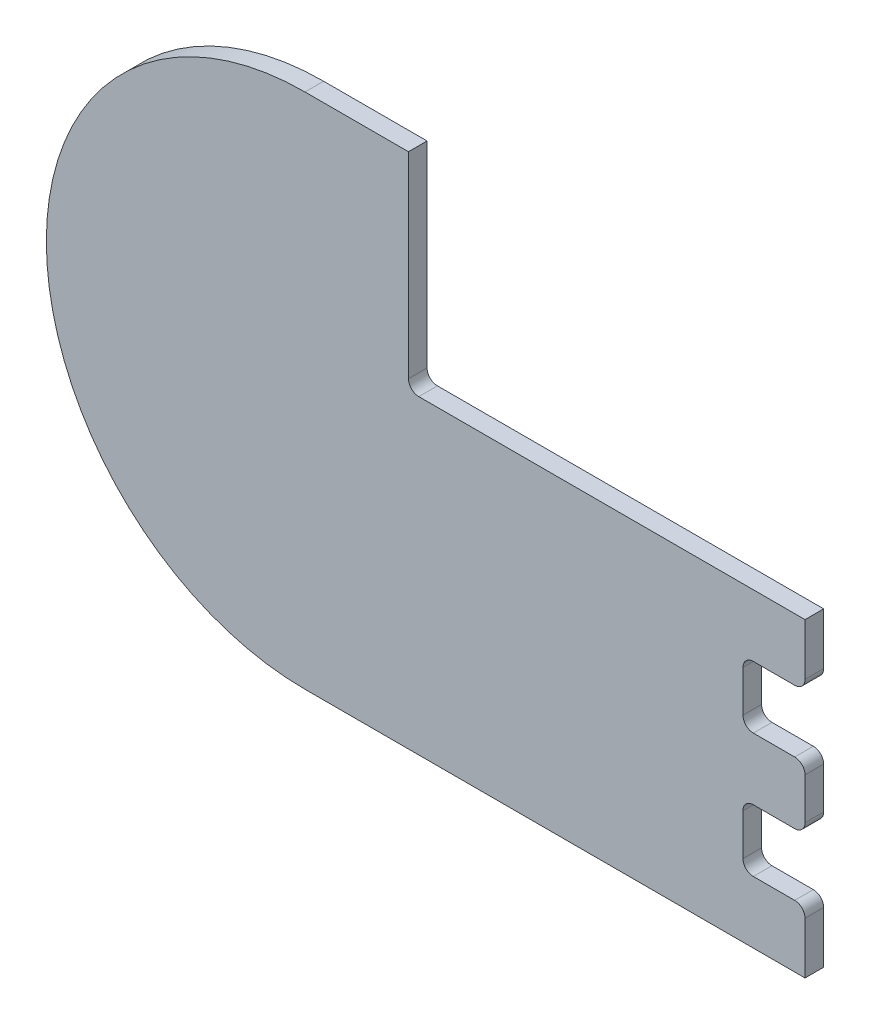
ISO-10303-21;
HEADER;
FILE_DESCRIPTION(('STEP AP214'),'2;1');
FILE_NAME('part.step','',(''),(''),'','','');
FILE_SCHEMA(('AUTOMOTIVE_DESIGN { 1 0 10303 214 1 1 1 1 }'));
ENDSEC;
DATA;
#1=APPLICATION_CONTEXT('core data for automotive mechanical design processes');
#2=APPLICATION_PROTOCOL_DEFINITION('international standard','automotive_design',2000,#1);
#3=PRODUCT_CONTEXT('',#1,'mechanical');
#4=PRODUCT('Part','Part','',(#3));
#5=PRODUCT_RELATED_PRODUCT_CATEGORY('part','',(#4));
#6=PRODUCT_DEFINITION_FORMATION('','',#4);
#7=PRODUCT_DEFINITION_CONTEXT('part definition',#1,'design');
#8=PRODUCT_DEFINITION('design','',#6,#7);
#9=PRODUCT_DEFINITION_SHAPE('','',#8);
#10=(LENGTH_UNIT() NAMED_UNIT(*) SI_UNIT(.MILLI.,.METRE.));
#11=(NAMED_UNIT(*) PLANE_ANGLE_UNIT() SI_UNIT($,.RADIAN.));
#12=(NAMED_UNIT(*) SI_UNIT($,.STERADIAN.) SOLID_ANGLE_UNIT());
#13=UNCERTAINTY_MEASURE_WITH_UNIT(LENGTH_MEASURE(1.E-05),#10,'distance_accuracy_value','');
#14=(GEOMETRIC_REPRESENTATION_CONTEXT(3) GLOBAL_UNCERTAINTY_ASSIGNED_CONTEXT((#13)) GLOBAL_UNIT_ASSIGNED_CONTEXT((#10,
#11,#12)) REPRESENTATION_CONTEXT('',''));
#15=CARTESIAN_POINT('',(0.,0.,0.));
#16=DIRECTION('',(0.,0.,1.));
#17=DIRECTION('',(1.,0.,0.));
#18=AXIS2_PLACEMENT_3D('',#15,#16,#17);
#19=CARTESIAN_POINT('',(-389.787987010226,-208.12132034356,9.));
#20=DIRECTION('',(0.,0.,-1.));
#21=DIRECTION('',(-1.,0.,0.));
#22=AXIS2_PLACEMENT_3D('',#19,#20,#21);
#23=PLANE('',#22);
#24=CARTESIAN_POINT('',(-389.787987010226,-208.12132034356,9.));
#25=DIRECTION('',(0.,0.,-1.));
#26=DIRECTION('',(-1.,0.,0.));
#27=AXIS2_PLACEMENT_3D('',#24,#25,#26);
#28=CIRCLE('',#27,3.);
#29=CARTESIAN_POINT('',(-391.909307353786,-206.,9.));
#30=VERTEX_POINT('',#29);
#31=CARTESIAN_POINT('',(-387.666666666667,-210.24264068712,9.));
#32=VERTEX_POINT('',#31);
#33=EDGE_CURVE('E656',#30,#32,#28,.T.);
#34=ORIENTED_EDGE('',*,*,#33,.T.);
#35=DIRECTION('',(0.,-1.,0.));
#36=VECTOR('',#35,1.);
#37=CARTESIAN_POINT('',(-387.666666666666,-229.75735931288,9.));
#38=LINE('',#37,#36);
#39=CARTESIAN_POINT('',(-387.666666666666,-229.75735931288,9.));
#40=VERTEX_POINT('',#39);
#41=EDGE_CURVE('E11',#32,#40,#38,.T.);
#42=ORIENTED_EDGE('',*,*,#41,.T.);
#43=CARTESIAN_POINT('',(-389.787987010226,-231.87867965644,9.));
#44=DIRECTION('',(0.,0.,-1.));
#45=DIRECTION('',(1.,0.,0.));
#46=AXIS2_PLACEMENT_3D('',#43,#44,#45);
#47=CIRCLE('',#46,3.);
#48=CARTESIAN_POINT('',(-391.909307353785,-234.,9.));
#49=VERTEX_POINT('',#48);
#50=EDGE_CURVE('E47',#40,#49,#47,.T.);
#51=ORIENTED_EDGE('',*,*,#50,.T.);
#52=DIRECTION('',(-1.,0.,0.));
#53=VECTOR('',#52,1.);
#54=CARTESIAN_POINT('',(-391.909307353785,-234.,9.));
#55=LINE('',#54,#53);
#56=CARTESIAN_POINT('',(-401.424025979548,-234.,9.));
#57=VERTEX_POINT('',#56);
#58=EDGE_CURVE('E55',#49,#57,#55,.T.);
#59=ORIENTED_EDGE('',*,*,#58,.T.);
#60=CARTESIAN_POINT('',(-403.545346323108,-231.87867965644,9.));
#61=DIRECTION('',(0.,0.,-1.));
#62=DIRECTION('',(-1.,0.,0.));
#63=AXIS2_PLACEMENT_3D('',#60,#61,#62);
#64=CIRCLE('',#63,2.99999999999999);
#65=CARTESIAN_POINT('',(-405.666666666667,-229.75735931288,9.));
#66=VERTEX_POINT('',#65);
#67=EDGE_CURVE('E680',#57,#66,#64,.T.);
#68=ORIENTED_EDGE('',*,*,#67,.T.);
#69=DIRECTION('',(0.,1.,0.));
#70=VECTOR('',#69,1.);
#71=CARTESIAN_POINT('',(-405.666666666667,-229.75735931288,9.));
#72=LINE('',#71,#70);
#73=CARTESIAN_POINT('',(-405.666666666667,-210.24264068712,9.));
#74=VERTEX_POINT('',#73);
#75=EDGE_CURVE('E674',#66,#74,#72,.T.);
#76=ORIENTED_EDGE('',*,*,#75,.T.);
#77=CARTESIAN_POINT('',(-403.545346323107,-208.12132034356,9.));
#78=DIRECTION('',(0.,0.,-1.));
#79=DIRECTION('',(1.,0.,0.));
#80=AXIS2_PLACEMENT_3D('',#77,#78,#79);
#81=CIRCLE('',#80,3.);
#82=CARTESIAN_POINT('',(-401.424025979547,-206.,9.));
#83=VERTEX_POINT('',#82);
#84=EDGE_CURVE('E668',#74,#83,#81,.T.);
#85=ORIENTED_EDGE('',*,*,#84,.T.);
#86=DIRECTION('',(1.,0.,0.));
#87=VECTOR('',#86,1.);
#88=CARTESIAN_POINT('',(-391.909307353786,-206.,9.));
#89=LINE('',#88,#87);
#90=EDGE_CURVE('E662',#83,#30,#89,.T.);
#91=ORIENTED_EDGE('',*,*,#90,.T.);
#92=EDGE_LOOP('',(#34,#42,#51,#59,#68,#76,#85,#91));
#93=FACE_BOUND('',#92,.T.);
#94=ADVANCED_FACE('F33',(#93),#23,.T.);
#95=CARTESIAN_POINT('',(-387.666666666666,-229.75735931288,9.));
#96=DIRECTION('',(1.,0.,0.));
#97=DIRECTION('',(0.,1.,0.));
#98=AXIS2_PLACEMENT_3D('',#95,#96,#97);
#99=PLANE('',#98);
#100=DIRECTION('',(0.,-1.,0.));
#101=VECTOR('',#100,1.);
#102=CARTESIAN_POINT('',(-387.666666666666,-229.75735931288,0.));
#103=LINE('',#102,#101);
#104=CARTESIAN_POINT('',(-387.666666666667,-210.24264068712,0.));
#105=VERTEX_POINT('',#104);
#106=CARTESIAN_POINT('',(-387.666666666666,-229.75735931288,0.));
#107=VERTEX_POINT('',#106);
#108=EDGE_CURVE('E650',#105,#107,#103,.T.);
#109=ORIENTED_EDGE('',*,*,#108,.T.);
#110=DIRECTION('',(0.,0.,-1.));
#111=VECTOR('',#110,1.);
#112=CARTESIAN_POINT('',(-387.666666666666,-229.75735931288,9.));
#113=LINE('',#112,#111);
#114=EDGE_CURVE('E40',#40,#107,#113,.T.);
#115=ORIENTED_EDGE('',*,*,#114,.F.);
#116=ORIENTED_EDGE('',*,*,#41,.F.);
#117=DIRECTION('',(0.,0.,-1.));
#118=VECTOR('',#117,1.);
#119=CARTESIAN_POINT('',(-387.666666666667,-210.24264068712,9.));
#120=LINE('',#119,#118);
#121=EDGE_CURVE('E653',#32,#105,#120,.T.);
#122=ORIENTED_EDGE('',*,*,#121,.T.);
#123=EDGE_LOOP('',(#109,#115,#116,#122));
#124=FACE_BOUND('',#123,.T.);
#125=ADVANCED_FACE('F692',(#124),#99,.F.);
#126=CARTESIAN_POINT('',(-389.787987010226,-231.87867965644,9.));
#127=DIRECTION('',(0.,0.,-1.));
#128=DIRECTION('',(-1.,0.,0.));
#129=AXIS2_PLACEMENT_3D('',#126,#127,#128);
#130=CYLINDRICAL_SURFACE('',#129,3.);
#131=CARTESIAN_POINT('',(-389.787987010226,-231.87867965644,0.));
#132=DIRECTION('',(0.,0.,-1.));
#133=DIRECTION('',(1.,0.,0.));
#134=AXIS2_PLACEMENT_3D('',#131,#132,#133);
#135=CIRCLE('',#134,3.);
#136=CARTESIAN_POINT('',(-391.909307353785,-234.,0.));
#137=VERTEX_POINT('',#136);
#138=EDGE_CURVE('E647',#107,#137,#135,.T.);
#139=ORIENTED_EDGE('',*,*,#138,.T.);
#140=DIRECTION('',(0.,0.,-1.));
#141=VECTOR('',#140,1.);
#142=CARTESIAN_POINT('',(-391.909307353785,-234.,9.));
#143=LINE('',#142,#141);
#144=EDGE_CURVE('E687',#49,#137,#143,.T.);
#145=ORIENTED_EDGE('',*,*,#144,.F.);
#146=ORIENTED_EDGE('',*,*,#50,.F.);
#147=ORIENTED_EDGE('',*,*,#114,.T.);
#148=EDGE_LOOP('',(#139,#145,#146,#147));
#149=FACE_BOUND('',#148,.T.);
#150=ADVANCED_FACE('F689',(#149),#130,.F.);
#151=CARTESIAN_POINT('',(-391.909307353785,-234.,9.));
#152=DIRECTION('',(0.,-1.,0.));
#153=DIRECTION('',(1.,0.,0.));
#154=AXIS2_PLACEMENT_3D('',#151,#152,#153);
#155=PLANE('',#154);
#156=DIRECTION('',(-1.,0.,0.));
#157=VECTOR('',#156,1.);
#158=CARTESIAN_POINT('',(-391.909307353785,-234.,0.));
#159=LINE('',#158,#157);
#160=CARTESIAN_POINT('',(-401.424025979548,-234.,0.));
#161=VERTEX_POINT('',#160);
#162=EDGE_CURVE('E644',#137,#161,#159,.T.);
#163=ORIENTED_EDGE('',*,*,#162,.T.);
#164=DIRECTION('',(0.,0.,-1.));
#165=VECTOR('',#164,1.);
#166=CARTESIAN_POINT('',(-401.424025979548,-234.,9.));
#167=LINE('',#166,#165);
#168=EDGE_CURVE('E683',#57,#161,#167,.T.);
#169=ORIENTED_EDGE('',*,*,#168,.F.);
#170=ORIENTED_EDGE('',*,*,#58,.F.);
#171=ORIENTED_EDGE('',*,*,#144,.T.);
#172=EDGE_LOOP('',(#163,#169,#170,#171));
#173=FACE_BOUND('',#172,.T.);
#174=ADVANCED_FACE('F711',(#173),#155,.F.);
#175=CARTESIAN_POINT('',(-403.545346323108,-231.87867965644,9.));
#176=DIRECTION('',(0.,0.,-1.));
#177=DIRECTION('',(-1.,0.,0.));
#178=AXIS2_PLACEMENT_3D('',#175,#176,#177);
#179=CYLINDRICAL_SURFACE('',#178,2.99999999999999);
#180=CARTESIAN_POINT('',(-403.545346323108,-231.87867965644,0.));
#181=DIRECTION('',(0.,0.,-1.));
#182=DIRECTION('',(-1.,0.,0.));
#183=AXIS2_PLACEMENT_3D('',#180,#181,#182);
#184=CIRCLE('',#183,2.99999999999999);
#185=CARTESIAN_POINT('',(-405.666666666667,-229.75735931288,0.));
#186=VERTEX_POINT('',#185);
#187=EDGE_CURVE('E641',#161,#186,#184,.T.);
#188=ORIENTED_EDGE('',*,*,#187,.T.);
#189=DIRECTION('',(0.,0.,-1.));
#190=VECTOR('',#189,1.);
#191=CARTESIAN_POINT('',(-405.666666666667,-229.75735931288,9.));
#192=LINE('',#191,#190);
#193=EDGE_CURVE('E677',#66,#186,#192,.T.);
#194=ORIENTED_EDGE('',*,*,#193,.F.);
#195=ORIENTED_EDGE('',*,*,#67,.F.);
#196=ORIENTED_EDGE('',*,*,#168,.T.);
#197=EDGE_LOOP('',(#188,#194,#195,#196));
#198=FACE_BOUND('',#197,.T.);
#199=ADVANCED_FACE('F710',(#198),#179,.F.);
#200=CARTESIAN_POINT('',(-405.666666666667,-229.75735931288,9.));
#201=DIRECTION('',(-1.,0.,0.));
#202=DIRECTION('',(0.,-1.,0.));
#203=AXIS2_PLACEMENT_3D('',#200,#201,#202);
#204=PLANE('',#203);
#205=DIRECTION('',(0.,1.,0.));
#206=VECTOR('',#205,1.);
#207=CARTESIAN_POINT('',(-405.666666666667,-229.75735931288,0.));
#208=LINE('',#207,#206);
#209=CARTESIAN_POINT('',(-405.666666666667,-210.24264068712,0.));
#210=VERTEX_POINT('',#209);
#211=EDGE_CURVE('E638',#186,#210,#208,.T.);
#212=ORIENTED_EDGE('',*,*,#211,.T.);
#213=DIRECTION('',(0.,0.,-1.));
#214=VECTOR('',#213,1.);
#215=CARTESIAN_POINT('',(-405.666666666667,-210.24264068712,9.));
#216=LINE('',#215,#214);
#217=EDGE_CURVE('E671',#74,#210,#216,.T.);
#218=ORIENTED_EDGE('',*,*,#217,.F.);
#219=ORIENTED_EDGE('',*,*,#75,.F.);
#220=ORIENTED_EDGE('',*,*,#193,.T.);
#221=EDGE_LOOP('',(#212,#218,#219,#220));
#222=FACE_BOUND('',#221,.T.);
#223=ADVANCED_FACE('F707',(#222),#204,.F.);
#224=CARTESIAN_POINT('',(-403.545346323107,-208.12132034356,9.));
#225=DIRECTION('',(0.,0.,-1.));
#226=DIRECTION('',(-1.,0.,0.));
#227=AXIS2_PLACEMENT_3D('',#224,#225,#226);
#228=CYLINDRICAL_SURFACE('',#227,3.);
#229=CARTESIAN_POINT('',(-403.545346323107,-208.12132034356,0.));
#230=DIRECTION('',(0.,0.,-1.));
#231=DIRECTION('',(1.,0.,0.));
#232=AXIS2_PLACEMENT_3D('',#229,#230,#231);
#233=CIRCLE('',#232,3.);
#234=CARTESIAN_POINT('',(-401.424025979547,-206.,0.));
#235=VERTEX_POINT('',#234);
#236=EDGE_CURVE('E635',#210,#235,#233,.T.);
#237=ORIENTED_EDGE('',*,*,#236,.T.);
#238=DIRECTION('',(0.,0.,-1.));
#239=VECTOR('',#238,1.);
#240=CARTESIAN_POINT('',(-401.424025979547,-206.,9.));
#241=LINE('',#240,#239);
#242=EDGE_CURVE('E665',#83,#235,#241,.T.);
#243=ORIENTED_EDGE('',*,*,#242,.F.);
#244=ORIENTED_EDGE('',*,*,#84,.F.);
#245=ORIENTED_EDGE('',*,*,#217,.T.);
#246=EDGE_LOOP('',(#237,#243,#244,#245));
#247=FACE_BOUND('',#246,.T.);
#248=ADVANCED_FACE('F704',(#247),#228,.F.);
#249=CARTESIAN_POINT('',(-391.909307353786,-206.,9.));
#250=DIRECTION('',(0.,1.,0.));
#251=DIRECTION('',(-1.,0.,0.));
#252=AXIS2_PLACEMENT_3D('',#249,#250,#251);
#253=PLANE('',#252);
#254=DIRECTION('',(1.,0.,0.));
#255=VECTOR('',#254,1.);
#256=CARTESIAN_POINT('',(-391.909307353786,-206.,0.));
#257=LINE('',#256,#255);
#258=CARTESIAN_POINT('',(-391.909307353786,-206.,0.));
#259=VERTEX_POINT('',#258);
#260=EDGE_CURVE('E632',#235,#259,#257,.T.);
#261=ORIENTED_EDGE('',*,*,#260,.T.);
#262=DIRECTION('',(0.,0.,-1.));
#263=VECTOR('',#262,1.);
#264=CARTESIAN_POINT('',(-391.909307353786,-206.,9.));
#265=LINE('',#264,#263);
#266=EDGE_CURVE('E659',#30,#259,#265,.T.);
#267=ORIENTED_EDGE('',*,*,#266,.F.);
#268=ORIENTED_EDGE('',*,*,#90,.F.);
#269=ORIENTED_EDGE('',*,*,#242,.T.);
#270=EDGE_LOOP('',(#261,#267,#268,#269));
#271=FACE_BOUND('',#270,.T.);
#272=ADVANCED_FACE('F699',(#271),#253,.F.);
#273=CARTESIAN_POINT('',(-389.787987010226,-208.12132034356,9.));
#274=DIRECTION('',(0.,0.,-1.));
#275=DIRECTION('',(-1.,0.,0.));
#276=AXIS2_PLACEMENT_3D('',#273,#274,#275);
#277=CYLINDRICAL_SURFACE('',#276,3.);
#278=CARTESIAN_POINT('',(-389.787987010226,-208.12132034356,0.));
#279=DIRECTION('',(0.,0.,-1.));
#280=DIRECTION('',(-1.,0.,0.));
#281=AXIS2_PLACEMENT_3D('',#278,#279,#280);
#282=CIRCLE('',#281,3.);
#283=EDGE_CURVE('E630',#259,#105,#282,.T.);
#284=ORIENTED_EDGE('',*,*,#283,.T.);
#285=ORIENTED_EDGE('',*,*,#121,.F.);
#286=ORIENTED_EDGE('',*,*,#33,.F.);
#287=ORIENTED_EDGE('',*,*,#266,.T.);
#288=EDGE_LOOP('',(#284,#285,#286,#287));
#289=FACE_BOUND('',#288,.T.);
#290=ADVANCED_FACE('F697',(#289),#277,.F.);
#291=CARTESIAN_POINT('',(850.,-1.11022302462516E-13,18.));
#292=DIRECTION('',(0.,0.,1.));
#293=DIRECTION('',(1.,0.,0.));
#294=AXIS2_PLACEMENT_3D('',#291,#292,#293);
#295=PLANE('',#294);
#296=DIRECTION('',(1.,0.,0.));
#297=VECTOR('',#296,1.);
#298=CARTESIAN_POINT('',(850.,-9.99999999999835,18.));
#299=LINE('',#298,#297);
#300=CARTESIAN_POINT('',(-416.666666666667,-10.0000000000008,18.));
#301=VERTEX_POINT('',#300);
#302=CARTESIAN_POINT('',(-376.666666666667,-10.0000000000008,18.));
#303=VERTEX_POINT('',#302);
#304=EDGE_CURVE('E513',#301,#303,#299,.T.);
#305=ORIENTED_EDGE('',*,*,#304,.T.);
#306=CARTESIAN_POINT('',(-376.666666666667,-7.6308558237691E-13,18.));
#307=DIRECTION('',(0.,0.,1.));
#308=DIRECTION('',(1.,0.,0.));
#309=AXIS2_PLACEMENT_3D('',#306,#307,#308);
#310=CIRCLE('',#309,10.);
#311=CARTESIAN_POINT('',(-366.666666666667,-7.44581865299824E-13,18.));
#312=VERTEX_POINT('',#311);
#313=EDGE_CURVE('E571',#303,#312,#310,.T.);
#314=ORIENTED_EDGE('',*,*,#313,.T.);
#315=DIRECTION('',(0.,1.,0.));
#316=VECTOR('',#315,1.);
#317=CARTESIAN_POINT('',(-366.666666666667,-2.36230788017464E-12,18.));
#318=LINE('',#317,#316);
#319=CARTESIAN_POINT('',(-366.666666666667,49.9999999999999,17.9999999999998));
#320=VERTEX_POINT('',#319);
#321=EDGE_CURVE('E487',#312,#320,#318,.T.);
#322=ORIENTED_EDGE('',*,*,#321,.T.);
#323=DIRECTION('',(1.,0.,0.));
#324=VECTOR('',#323,1.);
#325=CARTESIAN_POINT('',(-750.000000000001,49.9999999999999,17.9999999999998));
#326=LINE('',#325,#324);
#327=CARTESIAN_POINT('',(-740.000000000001,49.9999999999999,17.9999999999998));
#328=VERTEX_POINT('',#327);
#329=EDGE_CURVE('E517',#328,#320,#326,.T.);
#330=ORIENTED_EDGE('',*,*,#329,.F.);
#331=CARTESIAN_POINT('',(-740.000000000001,59.9999999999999,17.9999999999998));
#332=DIRECTION('',(0.,0.,1.));
#333=DIRECTION('',(1.,0.,0.));
#334=AXIS2_PLACEMENT_3D('',#331,#332,#333);
#335=CIRCLE('',#334,10.);
#336=CARTESIAN_POINT('',(-750.000000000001,59.9999999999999,17.9999999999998));
#337=VERTEX_POINT('',#336);
#338=EDGE_CURVE('E628',#328,#337,#335,.F.);
#339=ORIENTED_EDGE('',*,*,#338,.T.);
#340=DIRECTION('',(0.,-1.,0.));
#341=VECTOR('',#340,1.);
#342=CARTESIAN_POINT('',(-750.000000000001,250.,17.9999999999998));
#343=LINE('',#342,#341);
#344=CARTESIAN_POINT('',(-750.000000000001,250.,17.9999999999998));
#345=VERTEX_POINT('',#344);
#346=EDGE_CURVE('E520',#345,#337,#343,.T.);
#347=ORIENTED_EDGE('',*,*,#346,.F.);
#348=DIRECTION('',(-1.,0.,0.));
#349=VECTOR('',#348,1.);
#350=CARTESIAN_POINT('',(-850.000000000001,250.,18.));
#351=LINE('',#350,#349);
#352=CARTESIAN_POINT('',(-850.000000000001,250.,18.));
#353=VERTEX_POINT('',#352);
#354=EDGE_CURVE('E530',#345,#353,#351,.T.);
#355=ORIENTED_EDGE('',*,*,#354,.T.);
#356=CARTESIAN_POINT('',(-850.000000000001,-1.11022302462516E-13,18.));
#357=DIRECTION('',(0.,0.,1.));
#358=DIRECTION('',(1.,0.,0.));
#359=AXIS2_PLACEMENT_3D('',#356,#357,#358);
#360=CIRCLE('',#359,250.);
#361=CARTESIAN_POINT('',(-850.000000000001,-250.,18.));
#362=VERTEX_POINT('',#361);
#363=EDGE_CURVE('E532',#353,#362,#360,.T.);
#364=ORIENTED_EDGE('',*,*,#363,.T.);
#365=DIRECTION('',(1.,0.,0.));
#366=VECTOR('',#365,1.);
#367=CARTESIAN_POINT('',(-850.000000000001,-250.,18.));
#368=LINE('',#367,#366);
#369=CARTESIAN_POINT('',(-366.666666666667,-250.,18.));
#370=VERTEX_POINT('',#369);
#371=EDGE_CURVE('E535',#362,#370,#368,.T.);
#372=ORIENTED_EDGE('',*,*,#371,.T.);
#373=DIRECTION('',(0.,1.,0.));
#374=VECTOR('',#373,1.);
#375=CARTESIAN_POINT('',(-366.666666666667,-2.36230788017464E-12,18.));
#376=LINE('',#375,#374);
#377=CARTESIAN_POINT('',(-366.666666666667,-200.000000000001,18.));
#378=VERTEX_POINT('',#377);
#379=EDGE_CURVE('E492',#370,#378,#376,.T.);
#380=ORIENTED_EDGE('',*,*,#379,.T.);
#381=CARTESIAN_POINT('',(-376.666666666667,-200.000000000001,18.));
#382=DIRECTION('',(0.,0.,1.));
#383=DIRECTION('',(1.,0.,0.));
#384=AXIS2_PLACEMENT_3D('',#381,#382,#383);
#385=CIRCLE('',#384,10.);
#386=CARTESIAN_POINT('',(-376.666666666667,-190.000000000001,18.));
#387=VERTEX_POINT('',#386);
#388=EDGE_CURVE('E565',#378,#387,#385,.T.);
#389=ORIENTED_EDGE('',*,*,#388,.T.);
#390=DIRECTION('',(-1.,0.,0.));
#391=VECTOR('',#390,1.);
#392=CARTESIAN_POINT('',(850.,-189.999999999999,18.));
#393=LINE('',#392,#391);
#394=CARTESIAN_POINT('',(-416.666666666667,-190.000000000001,18.));
#395=VERTEX_POINT('',#394);
#396=EDGE_CURVE('E495',#387,#395,#393,.T.);
#397=ORIENTED_EDGE('',*,*,#396,.T.);
#398=CARTESIAN_POINT('',(-416.666666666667,-180.000000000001,18.));
#399=DIRECTION('',(0.,0.,1.));
#400=DIRECTION('',(1.,0.,0.));
#401=AXIS2_PLACEMENT_3D('',#398,#399,#400);
#402=CIRCLE('',#401,10.);
#403=CARTESIAN_POINT('',(-426.666666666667,-180.000000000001,18.));
#404=VERTEX_POINT('',#403);
#405=EDGE_CURVE('E607',#395,#404,#402,.F.);
#406=ORIENTED_EDGE('',*,*,#405,.T.);
#407=DIRECTION('',(0.,1.,0.));
#408=VECTOR('',#407,1.);
#409=CARTESIAN_POINT('',(-426.666666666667,-2.47333018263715E-12,18.));
#410=LINE('',#409,#408);
#411=CARTESIAN_POINT('',(-426.666666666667,-140.000000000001,18.));
#412=VERTEX_POINT('',#411);
#413=EDGE_CURVE('E498',#404,#412,#410,.T.);
#414=ORIENTED_EDGE('',*,*,#413,.T.);
#415=CARTESIAN_POINT('',(-416.666666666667,-140.000000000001,18.));
#416=DIRECTION('',(0.,0.,1.));
#417=DIRECTION('',(1.,0.,0.));
#418=AXIS2_PLACEMENT_3D('',#415,#416,#417);
#419=CIRCLE('',#418,10.);
#420=CARTESIAN_POINT('',(-416.666666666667,-130.000000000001,18.));
#421=VERTEX_POINT('',#420);
#422=EDGE_CURVE('E615',#412,#421,#419,.F.);
#423=ORIENTED_EDGE('',*,*,#422,.T.);
#424=DIRECTION('',(1.,0.,0.));
#425=VECTOR('',#424,1.);
#426=CARTESIAN_POINT('',(850.,-129.999999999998,18.));
#427=LINE('',#426,#425);
#428=CARTESIAN_POINT('',(-376.666666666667,-130.000000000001,18.));
#429=VERTEX_POINT('',#428);
#430=EDGE_CURVE('E501',#421,#429,#427,.T.);
#431=ORIENTED_EDGE('',*,*,#430,.T.);
#432=CARTESIAN_POINT('',(-376.666666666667,-120.000000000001,18.));
#433=DIRECTION('',(0.,0.,1.));
#434=DIRECTION('',(1.,0.,0.));
#435=AXIS2_PLACEMENT_3D('',#432,#433,#434);
#436=CIRCLE('',#435,10.);
#437=CARTESIAN_POINT('',(-366.666666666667,-120.000000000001,18.));
#438=VERTEX_POINT('',#437);
#439=EDGE_CURVE('E567',#429,#438,#436,.T.);
#440=ORIENTED_EDGE('',*,*,#439,.T.);
#441=DIRECTION('',(0.,1.,0.));
#442=VECTOR('',#441,1.);
#443=CARTESIAN_POINT('',(-366.666666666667,-2.36230788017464E-12,18.));
#444=LINE('',#443,#442);
#445=CARTESIAN_POINT('',(-366.666666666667,-80.0000000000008,18.));
#446=VERTEX_POINT('',#445);
#447=EDGE_CURVE('E504',#438,#446,#444,.T.);
#448=ORIENTED_EDGE('',*,*,#447,.T.);
#449=CARTESIAN_POINT('',(-376.666666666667,-80.0000000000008,18.));
#450=DIRECTION('',(0.,0.,1.));
#451=DIRECTION('',(1.,0.,0.));
#452=AXIS2_PLACEMENT_3D('',#449,#450,#451);
#453=CIRCLE('',#452,10.);
#454=CARTESIAN_POINT('',(-376.666666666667,-70.0000000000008,18.));
#455=VERTEX_POINT('',#454);
#456=EDGE_CURVE('E569',#446,#455,#453,.T.);
#457=ORIENTED_EDGE('',*,*,#456,.T.);
#458=DIRECTION('',(-1.,0.,0.));
#459=VECTOR('',#458,1.);
#460=CARTESIAN_POINT('',(850.,-69.9999999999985,18.));
#461=LINE('',#460,#459);
#462=CARTESIAN_POINT('',(-416.666666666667,-70.0000000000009,18.));
#463=VERTEX_POINT('',#462);
#464=EDGE_CURVE('E507',#455,#463,#461,.T.);
#465=ORIENTED_EDGE('',*,*,#464,.T.);
#466=CARTESIAN_POINT('',(-416.666666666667,-60.0000000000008,18.));
#467=DIRECTION('',(0.,0.,1.));
#468=DIRECTION('',(1.,0.,0.));
#469=AXIS2_PLACEMENT_3D('',#466,#467,#468);
#470=CIRCLE('',#469,10.);
#471=CARTESIAN_POINT('',(-426.666666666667,-60.0000000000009,18.));
#472=VERTEX_POINT('',#471);
#473=EDGE_CURVE('E611',#463,#472,#470,.F.);
#474=ORIENTED_EDGE('',*,*,#473,.T.);
#475=DIRECTION('',(0.,1.,0.));
#476=VECTOR('',#475,1.);
#477=CARTESIAN_POINT('',(-426.666666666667,-2.47333018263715E-12,18.));
#478=LINE('',#477,#476);
#479=CARTESIAN_POINT('',(-426.666666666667,-20.0000000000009,18.));
#480=VERTEX_POINT('',#479);
#481=EDGE_CURVE('E510',#472,#480,#478,.T.);
#482=ORIENTED_EDGE('',*,*,#481,.T.);
#483=CARTESIAN_POINT('',(-416.666666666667,-20.0000000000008,18.));
#484=DIRECTION('',(0.,0.,1.));
#485=DIRECTION('',(1.,0.,0.));
#486=AXIS2_PLACEMENT_3D('',#483,#484,#485);
#487=CIRCLE('',#486,10.);
#488=EDGE_CURVE('E619',#480,#301,#487,.F.);
#489=ORIENTED_EDGE('',*,*,#488,.T.);
#490=EDGE_LOOP('',(#305,#314,#322,#330,#339,#347,#355,#364,#372,#380,#389,#397,#406,#414,#423,
#431,#440,#448,#457,#465,#474,#482,#489));
#491=FACE_BOUND('',#490,.T.);
#492=ADVANCED_FACE('F774',(#491),#295,.T.);
#493=CARTESIAN_POINT('',(-850.000000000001,-250.,18.));
#494=DIRECTION('',(0.,1.,0.));
#495=DIRECTION('',(0.,0.,1.));
#496=AXIS2_PLACEMENT_3D('',#493,#494,#495);
#497=PLANE('',#496);
#498=DIRECTION('',(0.,0.,-1.));
#499=VECTOR('',#498,1.);
#500=CARTESIAN_POINT('',(-366.666666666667,-250.,30.));
#501=LINE('',#500,#499);
#502=CARTESIAN_POINT('',(-366.666666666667,-250.,0.));
#503=VERTEX_POINT('',#502);
#504=EDGE_CURVE('E483',#370,#503,#501,.T.);
#505=ORIENTED_EDGE('',*,*,#504,.F.);
#506=ORIENTED_EDGE('',*,*,#371,.F.);
#507=DIRECTION('',(0.,0.,-1.));
#508=VECTOR('',#507,1.);
#509=CARTESIAN_POINT('',(-850.000000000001,-250.,18.));
#510=LINE('',#509,#508);
#511=CARTESIAN_POINT('',(-850.000000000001,-250.,0.));
#512=VERTEX_POINT('',#511);
#513=EDGE_CURVE('E538',#362,#512,#510,.T.);
#514=ORIENTED_EDGE('',*,*,#513,.T.);
#515=DIRECTION('',(1.,0.,0.));
#516=VECTOR('',#515,1.);
#517=CARTESIAN_POINT('',(-850.000000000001,-250.,0.));
#518=LINE('',#517,#516);
#519=EDGE_CURVE('E533',#512,#503,#518,.T.);
#520=ORIENTED_EDGE('',*,*,#519,.T.);
#521=EDGE_LOOP('',(#505,#506,#514,#520));
#522=FACE_BOUND('',#521,.T.);
#523=ADVANCED_FACE('F785',(#522),#497,.F.);
#524=CARTESIAN_POINT('',(850.,-1.11022302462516E-13,0.));
#525=DIRECTION('',(0.,0.,1.));
#526=DIRECTION('',(1.,0.,0.));
#527=AXIS2_PLACEMENT_3D('',#524,#525,#526);
#528=PLANE('',#527);
#529=DIRECTION('',(0.,-1.,0.));
#530=VECTOR('',#529,1.);
#531=CARTESIAN_POINT('',(-387.666666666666,-109.75735931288,0.));
#532=LINE('',#531,#530);
#533=CARTESIAN_POINT('',(-387.666666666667,-90.2426406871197,0.));
#534=VERTEX_POINT('',#533);
#535=CARTESIAN_POINT('',(-387.666666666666,-109.75735931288,0.));
#536=VERTEX_POINT('',#535);
#537=EDGE_CURVE('E344',#534,#536,#532,.T.);
#538=ORIENTED_EDGE('',*,*,#537,.F.);
#539=CARTESIAN_POINT('',(-389.787987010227,-88.1213203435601,0.));
#540=DIRECTION('',(0.,0.,-1.));
#541=DIRECTION('',(-1.,0.,0.));
#542=AXIS2_PLACEMENT_3D('',#539,#540,#541);
#543=CIRCLE('',#542,3.);
#544=CARTESIAN_POINT('',(-391.909307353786,-86.0000000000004,0.));
#545=VERTEX_POINT('',#544);
#546=EDGE_CURVE('E358',#545,#534,#543,.T.);
#547=ORIENTED_EDGE('',*,*,#546,.F.);
#548=DIRECTION('',(1.,0.,0.));
#549=VECTOR('',#548,1.);
#550=CARTESIAN_POINT('',(-391.909307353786,-86.0000000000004,0.));
#551=LINE('',#550,#549);
#552=CARTESIAN_POINT('',(-401.424025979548,-86.0000000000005,0.));
#553=VERTEX_POINT('',#552);
#554=EDGE_CURVE('E388',#553,#545,#551,.T.);
#555=ORIENTED_EDGE('',*,*,#554,.F.);
#556=CARTESIAN_POINT('',(-403.545346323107,-88.1213203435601,0.));
#557=DIRECTION('',(0.,0.,-1.));
#558=DIRECTION('',(1.,0.,0.));
#559=AXIS2_PLACEMENT_3D('',#556,#557,#558);
#560=CIRCLE('',#559,3.);
#561=CARTESIAN_POINT('',(-405.666666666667,-90.2426406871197,0.));
#562=VERTEX_POINT('',#561);
#563=EDGE_CURVE('E383',#562,#553,#560,.T.);
#564=ORIENTED_EDGE('',*,*,#563,.F.);
#565=DIRECTION('',(0.,1.,0.));
#566=VECTOR('',#565,1.);
#567=CARTESIAN_POINT('',(-405.666666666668,-109.75735931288,0.));
#568=LINE('',#567,#566);
#569=CARTESIAN_POINT('',(-405.666666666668,-109.75735931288,0.));
#570=VERTEX_POINT('',#569);
#571=EDGE_CURVE('E378',#570,#562,#568,.T.);
#572=ORIENTED_EDGE('',*,*,#571,.F.);
#573=CARTESIAN_POINT('',(-403.545346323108,-111.87867965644,0.));
#574=DIRECTION('',(0.,0.,-1.));
#575=DIRECTION('',(-1.,0.,0.));
#576=AXIS2_PLACEMENT_3D('',#573,#574,#575);
#577=CIRCLE('',#576,2.99999999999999);
#578=CARTESIAN_POINT('',(-401.424025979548,-114.,0.));
#579=VERTEX_POINT('',#578);
#580=EDGE_CURVE('E373',#579,#570,#577,.T.);
#581=ORIENTED_EDGE('',*,*,#580,.F.);
#582=DIRECTION('',(-1.,0.,0.));
#583=VECTOR('',#582,1.);
#584=CARTESIAN_POINT('',(-391.909307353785,-114.,0.));
#585=LINE('',#584,#583);
#586=CARTESIAN_POINT('',(-391.909307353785,-114.,0.));
#587=VERTEX_POINT('',#586);
#588=EDGE_CURVE('E368',#587,#579,#585,.T.);
#589=ORIENTED_EDGE('',*,*,#588,.F.);
#590=CARTESIAN_POINT('',(-389.787987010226,-111.87867965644,0.));
#591=DIRECTION('',(0.,0.,-1.));
#592=DIRECTION('',(1.,0.,0.));
#593=AXIS2_PLACEMENT_3D('',#590,#591,#592);
#594=CIRCLE('',#593,3.);
#595=EDGE_CURVE('E359',#536,#587,#594,.T.);
#596=ORIENTED_EDGE('',*,*,#595,.F.);
#597=EDGE_LOOP('',(#538,#547,#555,#564,#572,#581,#589,#596));
#598=FACE_BOUND('',#597,.T.);
#599=DIRECTION('',(0.,-1.,0.));
#600=VECTOR('',#599,1.);
#601=CARTESIAN_POINT('',(-387.666666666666,10.2426406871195,0.));
#602=LINE('',#601,#600);
#603=CARTESIAN_POINT('',(-387.666666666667,29.7573593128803,0.));
#604=VERTEX_POINT('',#603);
#605=CARTESIAN_POINT('',(-387.666666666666,10.2426406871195,0.));
#606=VERTEX_POINT('',#605);
#607=EDGE_CURVE('E421',#604,#606,#602,.T.);
#608=ORIENTED_EDGE('',*,*,#607,.F.);
#609=CARTESIAN_POINT('',(-389.787987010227,31.8786796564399,0.));
#610=DIRECTION('',(0.,0.,-1.));
#611=DIRECTION('',(-1.,0.,0.));
#612=AXIS2_PLACEMENT_3D('',#609,#610,#611);
#613=CIRCLE('',#612,3.);
#614=CARTESIAN_POINT('',(-391.909307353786,33.9999999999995,0.));
#615=VERTEX_POINT('',#614);
#616=EDGE_CURVE('E393',#615,#604,#613,.T.);
#617=ORIENTED_EDGE('',*,*,#616,.F.);
#618=DIRECTION('',(1.,0.,0.));
#619=VECTOR('',#618,1.);
#620=CARTESIAN_POINT('',(-391.909307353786,33.9999999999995,0.));
#621=LINE('',#620,#619);
#622=CARTESIAN_POINT('',(-401.424025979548,33.9999999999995,0.));
#623=VERTEX_POINT('',#622);
#624=EDGE_CURVE('E398',#623,#615,#621,.T.);
#625=ORIENTED_EDGE('',*,*,#624,.F.);
#626=CARTESIAN_POINT('',(-403.545346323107,31.8786796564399,0.));
#627=DIRECTION('',(0.,0.,-1.));
#628=DIRECTION('',(1.,0.,0.));
#629=AXIS2_PLACEMENT_3D('',#626,#627,#628);
#630=CIRCLE('',#629,3.);
#631=CARTESIAN_POINT('',(-405.666666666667,29.7573593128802,0.));
#632=VERTEX_POINT('',#631);
#633=EDGE_CURVE('E436',#632,#623,#630,.T.);
#634=ORIENTED_EDGE('',*,*,#633,.F.);
#635=DIRECTION('',(0.,1.,0.));
#636=VECTOR('',#635,1.);
#637=CARTESIAN_POINT('',(-405.666666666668,10.2426406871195,0.));
#638=LINE('',#637,#636);
#639=CARTESIAN_POINT('',(-405.666666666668,10.2426406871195,0.));
#640=VERTEX_POINT('',#639);
#641=EDGE_CURVE('E433',#640,#632,#638,.T.);
#642=ORIENTED_EDGE('',*,*,#641,.F.);
#643=CARTESIAN_POINT('',(-403.545346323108,8.12132034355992,0.));
#644=DIRECTION('',(0.,0.,-1.));
#645=DIRECTION('',(-1.,0.,0.));
#646=AXIS2_PLACEMENT_3D('',#643,#644,#645);
#647=CIRCLE('',#646,2.99999999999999);
#648=CARTESIAN_POINT('',(-401.424025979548,6.00000000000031,0.));
#649=VERTEX_POINT('',#648);
#650=EDGE_CURVE('E430',#649,#640,#647,.T.);
#651=ORIENTED_EDGE('',*,*,#650,.F.);
#652=DIRECTION('',(-1.,0.,0.));
#653=VECTOR('',#652,1.);
#654=CARTESIAN_POINT('',(-391.909307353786,6.00000000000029,0.));
#655=LINE('',#654,#653);
#656=CARTESIAN_POINT('',(-391.909307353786,6.00000000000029,0.));
#657=VERTEX_POINT('',#656);
#658=EDGE_CURVE('E427',#657,#649,#655,.T.);
#659=ORIENTED_EDGE('',*,*,#658,.F.);
#660=CARTESIAN_POINT('',(-389.787987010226,8.12132034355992,0.));
#661=DIRECTION('',(0.,0.,-1.));
#662=DIRECTION('',(1.,0.,0.));
#663=AXIS2_PLACEMENT_3D('',#660,#661,#662);
#664=CIRCLE('',#663,3.);
#665=EDGE_CURVE('E424',#606,#657,#664,.T.);
#666=ORIENTED_EDGE('',*,*,#665,.F.);
#667=EDGE_LOOP('',(#608,#617,#625,#634,#642,#651,#659,#666));
#668=FACE_BOUND('',#667,.T.);
#669=DIRECTION('',(0.,-1.,0.));
#670=VECTOR('',#669,1.);
#671=CARTESIAN_POINT('',(-366.666666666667,-6.78469626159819E-13,0.));
#672=LINE('',#671,#670);
#673=CARTESIAN_POINT('',(-366.666666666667,49.9999999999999,0.));
#674=VERTEX_POINT('',#673);
#675=CARTESIAN_POINT('',(-366.666666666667,-7.44581865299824E-13,0.));
#676=VERTEX_POINT('',#675);
#677=EDGE_CURVE('E480',#674,#676,#672,.T.);
#678=ORIENTED_EDGE('',*,*,#677,.T.);
#679=CARTESIAN_POINT('',(-376.666666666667,-7.6308558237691E-13,0.));
#680=DIRECTION('',(0.,0.,1.));
#681=DIRECTION('',(1.,0.,0.));
#682=AXIS2_PLACEMENT_3D('',#679,#680,#681);
#683=CIRCLE('',#682,10.);
#684=CARTESIAN_POINT('',(-376.666666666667,-10.0000000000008,0.));
#685=VERTEX_POINT('',#684);
#686=EDGE_CURVE('E558',#676,#685,#683,.F.);
#687=ORIENTED_EDGE('',*,*,#686,.T.);
#688=DIRECTION('',(-1.,0.,0.));
#689=VECTOR('',#688,1.);
#690=CARTESIAN_POINT('',(0.,-10.,0.));
#691=LINE('',#690,#689);
#692=CARTESIAN_POINT('',(-416.666666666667,-10.0000000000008,0.));
#693=VERTEX_POINT('',#692);
#694=EDGE_CURVE('E477',#685,#693,#691,.T.);
#695=ORIENTED_EDGE('',*,*,#694,.T.);
#696=CARTESIAN_POINT('',(-416.666666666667,-20.0000000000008,0.));
#697=DIRECTION('',(0.,0.,1.));
#698=DIRECTION('',(1.,0.,0.));
#699=AXIS2_PLACEMENT_3D('',#696,#697,#698);
#700=CIRCLE('',#699,10.);
#701=CARTESIAN_POINT('',(-426.666666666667,-20.0000000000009,0.));
#702=VERTEX_POINT('',#701);
#703=EDGE_CURVE('E617',#693,#702,#700,.T.);
#704=ORIENTED_EDGE('',*,*,#703,.T.);
#705=DIRECTION('',(0.,-1.,0.));
#706=VECTOR('',#705,1.);
#707=CARTESIAN_POINT('',(-426.666666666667,-7.89491928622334E-13,0.));
#708=LINE('',#707,#706);
#709=CARTESIAN_POINT('',(-426.666666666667,-60.0000000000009,0.));
#710=VERTEX_POINT('',#709);
#711=EDGE_CURVE('E474',#702,#710,#708,.T.);
#712=ORIENTED_EDGE('',*,*,#711,.T.);
#713=CARTESIAN_POINT('',(-416.666666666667,-60.0000000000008,0.));
#714=DIRECTION('',(0.,0.,1.));
#715=DIRECTION('',(1.,0.,0.));
#716=AXIS2_PLACEMENT_3D('',#713,#714,#715);
#717=CIRCLE('',#716,10.);
#718=CARTESIAN_POINT('',(-416.666666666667,-70.0000000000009,0.));
#719=VERTEX_POINT('',#718);
#720=EDGE_CURVE('E609',#710,#719,#717,.T.);
#721=ORIENTED_EDGE('',*,*,#720,.T.);
#722=DIRECTION('',(1.,0.,0.));
#723=VECTOR('',#722,1.);
#724=CARTESIAN_POINT('',(1.29526019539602E-13,-70.0000000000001,0.));
#725=LINE('',#724,#723);
#726=CARTESIAN_POINT('',(-376.666666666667,-70.0000000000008,0.));
#727=VERTEX_POINT('',#726);
#728=EDGE_CURVE('E471',#719,#727,#725,.T.);
#729=ORIENTED_EDGE('',*,*,#728,.T.);
#730=CARTESIAN_POINT('',(-376.666666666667,-80.0000000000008,0.));
#731=DIRECTION('',(0.,0.,1.));
#732=DIRECTION('',(1.,0.,0.));
#733=AXIS2_PLACEMENT_3D('',#730,#731,#732);
#734=CIRCLE('',#733,10.);
#735=CARTESIAN_POINT('',(-366.666666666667,-80.0000000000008,0.));
#736=VERTEX_POINT('',#735);
#737=EDGE_CURVE('E556',#727,#736,#734,.F.);
#738=ORIENTED_EDGE('',*,*,#737,.T.);
#739=DIRECTION('',(0.,-1.,0.));
#740=VECTOR('',#739,1.);
#741=CARTESIAN_POINT('',(-366.666666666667,-6.78469626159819E-13,0.));
#742=LINE('',#741,#740);
#743=CARTESIAN_POINT('',(-366.666666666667,-120.000000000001,0.));
#744=VERTEX_POINT('',#743);
#745=EDGE_CURVE('E468',#736,#744,#742,.T.);
#746=ORIENTED_EDGE('',*,*,#745,.T.);
#747=CARTESIAN_POINT('',(-376.666666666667,-120.000000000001,0.));
#748=DIRECTION('',(0.,0.,1.));
#749=DIRECTION('',(1.,0.,0.));
#750=AXIS2_PLACEMENT_3D('',#747,#748,#749);
#751=CIRCLE('',#750,10.);
#752=CARTESIAN_POINT('',(-376.666666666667,-130.000000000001,0.));
#753=VERTEX_POINT('',#752);
#754=EDGE_CURVE('E554',#744,#753,#751,.F.);
#755=ORIENTED_EDGE('',*,*,#754,.T.);
#756=DIRECTION('',(-1.,0.,0.));
#757=VECTOR('',#756,1.);
#758=CARTESIAN_POINT('',(3.00685402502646E-13,-130.,0.));
#759=LINE('',#758,#757);
#760=CARTESIAN_POINT('',(-416.666666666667,-130.000000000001,0.));
#761=VERTEX_POINT('',#760);
#762=EDGE_CURVE('E465',#753,#761,#759,.T.);
#763=ORIENTED_EDGE('',*,*,#762,.T.);
#764=CARTESIAN_POINT('',(-416.666666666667,-140.000000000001,0.));
#765=DIRECTION('',(0.,0.,1.));
#766=DIRECTION('',(1.,0.,0.));
#767=AXIS2_PLACEMENT_3D('',#764,#765,#766);
#768=CIRCLE('',#767,10.);
#769=CARTESIAN_POINT('',(-426.666666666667,-140.000000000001,0.));
#770=VERTEX_POINT('',#769);
#771=EDGE_CURVE('E613',#761,#770,#768,.T.);
#772=ORIENTED_EDGE('',*,*,#771,.T.);
#773=DIRECTION('',(0.,-1.,0.));
#774=VECTOR('',#773,1.);
#775=CARTESIAN_POINT('',(-426.666666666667,-7.89491928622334E-13,0.));
#776=LINE('',#775,#774);
#777=CARTESIAN_POINT('',(-426.666666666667,-180.000000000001,0.));
#778=VERTEX_POINT('',#777);
#779=EDGE_CURVE('E462',#770,#778,#776,.T.);
#780=ORIENTED_EDGE('',*,*,#779,.T.);
#781=CARTESIAN_POINT('',(-416.666666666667,-180.000000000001,0.));
#782=DIRECTION('',(0.,0.,1.));
#783=DIRECTION('',(1.,0.,0.));
#784=AXIS2_PLACEMENT_3D('',#781,#782,#783);
#785=CIRCLE('',#784,10.);
#786=CARTESIAN_POINT('',(-416.666666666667,-190.000000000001,0.));
#787=VERTEX_POINT('',#786);
#788=EDGE_CURVE('E605',#778,#787,#785,.T.);
#789=ORIENTED_EDGE('',*,*,#788,.T.);
#790=DIRECTION('',(1.,0.,0.));
#791=VECTOR('',#790,1.);
#792=CARTESIAN_POINT('',(3.51570624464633E-13,-190.,0.));
#793=LINE('',#792,#791);
#794=CARTESIAN_POINT('',(-376.666666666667,-190.000000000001,0.));
#795=VERTEX_POINT('',#794);
#796=EDGE_CURVE('E459',#787,#795,#793,.T.);
#797=ORIENTED_EDGE('',*,*,#796,.T.);
#798=CARTESIAN_POINT('',(-376.666666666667,-200.000000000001,0.));
#799=DIRECTION('',(0.,0.,1.));
#800=DIRECTION('',(1.,0.,0.));
#801=AXIS2_PLACEMENT_3D('',#798,#799,#800);
#802=CIRCLE('',#801,10.);
#803=CARTESIAN_POINT('',(-366.666666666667,-200.000000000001,0.));
#804=VERTEX_POINT('',#803);
#805=EDGE_CURVE('E552',#795,#804,#802,.F.);
#806=ORIENTED_EDGE('',*,*,#805,.T.);
#807=DIRECTION('',(0.,-1.,0.));
#808=VECTOR('',#807,1.);
#809=CARTESIAN_POINT('',(-366.666666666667,-6.78469626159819E-13,0.));
#810=LINE('',#809,#808);
#811=EDGE_CURVE('E443',#804,#503,#810,.T.);
#812=ORIENTED_EDGE('',*,*,#811,.T.);
#813=ORIENTED_EDGE('',*,*,#519,.F.);
#814=CARTESIAN_POINT('',(-850.000000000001,-1.11022302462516E-13,0.));
#815=DIRECTION('',(0.,0.,1.));
#816=DIRECTION('',(1.,0.,0.));
#817=AXIS2_PLACEMENT_3D('',#814,#815,#816);
#818=CIRCLE('',#817,250.);
#819=CARTESIAN_POINT('',(-850.000000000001,250.,0.));
#820=VERTEX_POINT('',#819);
#821=EDGE_CURVE('E540',#820,#512,#818,.T.);
#822=ORIENTED_EDGE('',*,*,#821,.F.);
#823=DIRECTION('',(-1.,0.,0.));
#824=VECTOR('',#823,1.);
#825=CARTESIAN_POINT('',(-850.000000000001,250.,0.));
#826=LINE('',#825,#824);
#827=CARTESIAN_POINT('',(-750.,250.,0.));
#828=VERTEX_POINT('',#827);
#829=EDGE_CURVE('E519',#828,#820,#826,.T.);
#830=ORIENTED_EDGE('',*,*,#829,.F.);
#831=DIRECTION('',(0.,-1.,0.));
#832=VECTOR('',#831,1.);
#833=CARTESIAN_POINT('',(-750.000000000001,250.,0.));
#834=LINE('',#833,#832);
#835=CARTESIAN_POINT('',(-750.000000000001,59.9999999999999,0.));
#836=VERTEX_POINT('',#835);
#837=EDGE_CURVE('E522',#828,#836,#834,.T.);
#838=ORIENTED_EDGE('',*,*,#837,.T.);
#839=CARTESIAN_POINT('',(-740.000000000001,59.9999999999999,0.));
#840=DIRECTION('',(0.,0.,1.));
#841=DIRECTION('',(1.,0.,0.));
#842=AXIS2_PLACEMENT_3D('',#839,#840,#841);
#843=CIRCLE('',#842,10.);
#844=CARTESIAN_POINT('',(-740.000000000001,49.9999999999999,0.));
#845=VERTEX_POINT('',#844);
#846=EDGE_CURVE('E626',#836,#845,#843,.T.);
#847=ORIENTED_EDGE('',*,*,#846,.T.);
#848=DIRECTION('',(1.,0.,0.));
#849=VECTOR('',#848,1.);
#850=CARTESIAN_POINT('',(-750.000000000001,49.9999999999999,0.));
#851=LINE('',#850,#849);
#852=EDGE_CURVE('E516',#845,#674,#851,.T.);
#853=ORIENTED_EDGE('',*,*,#852,.T.);
#854=EDGE_LOOP('',(#678,#687,#695,#704,#712,#721,#729,#738,#746,#755,#763,#772,#780,#789,#797,
#806,#812,#813,#822,#830,#838,#847,#853));
#855=FACE_BOUND('',#854,.T.);
#856=ORIENTED_EDGE('',*,*,#283,.F.);
#857=ORIENTED_EDGE('',*,*,#260,.F.);
#858=ORIENTED_EDGE('',*,*,#236,.F.);
#859=ORIENTED_EDGE('',*,*,#211,.F.);
#860=ORIENTED_EDGE('',*,*,#187,.F.);
#861=ORIENTED_EDGE('',*,*,#162,.F.);
#862=ORIENTED_EDGE('',*,*,#138,.F.);
#863=ORIENTED_EDGE('',*,*,#108,.F.);
#864=EDGE_LOOP('',(#856,#857,#858,#859,#860,#861,#862,#863));
#865=FACE_BOUND('',#864,.T.);
#866=ADVANCED_FACE('F702',(#598,#668,#855,#865),#528,.F.);
#867=CARTESIAN_POINT('',(-750.000000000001,49.9999999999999,2860.71829828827));
#868=DIRECTION('',(0.,1.,0.));
#869=DIRECTION('',(0.,0.,1.));
#870=AXIS2_PLACEMENT_3D('',#867,#868,#869);
#871=PLANE('',#870);
#872=ORIENTED_EDGE('',*,*,#852,.F.);
#873=DIRECTION('',(0.,0.,-1.));
#874=VECTOR('',#873,1.);
#875=CARTESIAN_POINT('',(-740.000000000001,49.9999999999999,17.9999999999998));
#876=LINE('',#875,#874);
#877=EDGE_CURVE('E624',#845,#328,#876,.F.);
#878=ORIENTED_EDGE('',*,*,#877,.T.);
#879=ORIENTED_EDGE('',*,*,#329,.T.);
#880=DIRECTION('',(0.,0.,-1.));
#881=VECTOR('',#880,1.);
#882=CARTESIAN_POINT('',(-366.666666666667,49.9999999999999,30.));
#883=LINE('',#882,#881);
#884=EDGE_CURVE('E484',#320,#674,#883,.T.);
#885=ORIENTED_EDGE('',*,*,#884,.T.);
#886=EDGE_LOOP('',(#872,#878,#879,#885));
#887=FACE_BOUND('',#886,.T.);
#888=ADVANCED_FACE('F784',(#887),#871,.T.);
#889=CARTESIAN_POINT('',(-850.000000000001,250.,18.));
#890=DIRECTION('',(0.,-1.,0.));
#891=DIRECTION('',(0.,0.,-1.));
#892=AXIS2_PLACEMENT_3D('',#889,#890,#891);
#893=PLANE('',#892);
#894=DIRECTION('',(0.,0.,-1.));
#895=VECTOR('',#894,1.);
#896=CARTESIAN_POINT('',(-750.000000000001,250.,2860.71829828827));
#897=LINE('',#896,#895);
#898=EDGE_CURVE('E525',#345,#828,#897,.T.);
#899=ORIENTED_EDGE('',*,*,#898,.T.);
#900=ORIENTED_EDGE('',*,*,#829,.T.);
#901=DIRECTION('',(0.,0.,-1.));
#902=VECTOR('',#901,1.);
#903=CARTESIAN_POINT('',(-850.000000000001,250.,18.));
#904=LINE('',#903,#902);
#905=EDGE_CURVE('E546',#353,#820,#904,.T.);
#906=ORIENTED_EDGE('',*,*,#905,.F.);
#907=ORIENTED_EDGE('',*,*,#354,.F.);
#908=EDGE_LOOP('',(#899,#900,#906,#907));
#909=FACE_BOUND('',#908,.T.);
#910=ADVANCED_FACE('F956',(#909),#893,.F.);
#911=CARTESIAN_POINT('',(-850.000000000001,-1.11022302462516E-13,18.));
#912=DIRECTION('',(0.,0.,-1.));
#913=DIRECTION('',(-1.,0.,0.));
#914=AXIS2_PLACEMENT_3D('',#911,#912,#913);
#915=CYLINDRICAL_SURFACE('',#914,250.);
#916=ORIENTED_EDGE('',*,*,#821,.T.);
#917=ORIENTED_EDGE('',*,*,#513,.F.);
#918=ORIENTED_EDGE('',*,*,#363,.F.);
#919=ORIENTED_EDGE('',*,*,#905,.T.);
#920=EDGE_LOOP('',(#916,#917,#918,#919));
#921=FACE_BOUND('',#920,.T.);
#922=ADVANCED_FACE('F952',(#921),#915,.T.);
#923=CARTESIAN_POINT('',(-750.000000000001,250.,2860.71829828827));
#924=DIRECTION('',(1.,0.,0.));
#925=DIRECTION('',(0.,0.,-1.));
#926=AXIS2_PLACEMENT_3D('',#923,#924,#925);
#927=PLANE('',#926);
#928=ORIENTED_EDGE('',*,*,#346,.T.);
#929=DIRECTION('',(0.,0.,-1.));
#930=VECTOR('',#929,1.);
#931=CARTESIAN_POINT('',(-750.000000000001,59.9999999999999,0.));
#932=LINE('',#931,#930);
#933=EDGE_CURVE('E621',#337,#836,#932,.T.);
#934=ORIENTED_EDGE('',*,*,#933,.T.);
#935=ORIENTED_EDGE('',*,*,#837,.F.);
#936=ORIENTED_EDGE('',*,*,#898,.F.);
#937=EDGE_LOOP('',(#928,#934,#935,#936));
#938=FACE_BOUND('',#937,.T.);
#939=ADVANCED_FACE('F916',(#938),#927,.T.);
#940=CARTESIAN_POINT('',(-366.666666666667,-6.78469626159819E-13,30.));
#941=DIRECTION('',(1.,0.,0.));
#942=DIRECTION('',(0.,1.,0.));
#943=AXIS2_PLACEMENT_3D('',#940,#941,#942);
#944=PLANE('',#943);
#945=ORIENTED_EDGE('',*,*,#321,.F.);
#946=DIRECTION('',(0.,0.,-1.));
#947=VECTOR('',#946,1.);
#948=CARTESIAN_POINT('',(-366.666666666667,-7.44581865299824E-13,30.));
#949=LINE('',#948,#947);
#950=EDGE_CURVE('E549',#312,#676,#949,.T.);
#951=ORIENTED_EDGE('',*,*,#950,.T.);
#952=ORIENTED_EDGE('',*,*,#677,.F.);
#953=ORIENTED_EDGE('',*,*,#884,.F.);
#954=EDGE_LOOP('',(#945,#951,#952,#953));
#955=FACE_BOUND('',#954,.T.);
#956=ADVANCED_FACE('F912',(#955),#944,.T.);
#957=CARTESIAN_POINT('',(0.,-10.,30.));
#958=DIRECTION('',(0.,-1.,0.));
#959=DIRECTION('',(1.,0.,0.));
#960=AXIS2_PLACEMENT_3D('',#957,#958,#959);
#961=PLANE('',#960);
#962=ORIENTED_EDGE('',*,*,#694,.F.);
#963=DIRECTION('',(0.,0.,-1.));
#964=VECTOR('',#963,1.);
#965=CARTESIAN_POINT('',(-376.666666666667,-10.0000000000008,30.));
#966=LINE('',#965,#964);
#967=EDGE_CURVE('E563',#685,#303,#966,.F.);
#968=ORIENTED_EDGE('',*,*,#967,.T.);
#969=ORIENTED_EDGE('',*,*,#304,.F.);
#970=DIRECTION('',(0.,0.,-1.));
#971=VECTOR('',#970,1.);
#972=CARTESIAN_POINT('',(-416.666666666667,-10.0000000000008,0.));
#973=LINE('',#972,#971);
#974=EDGE_CURVE('E560',#301,#693,#973,.T.);
#975=ORIENTED_EDGE('',*,*,#974,.T.);
#976=EDGE_LOOP('',(#962,#968,#969,#975));
#977=FACE_BOUND('',#976,.T.);
#978=ADVANCED_FACE('F915',(#977),#961,.T.);
#979=CARTESIAN_POINT('',(-426.666666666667,-7.89491928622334E-13,30.));
#980=DIRECTION('',(1.,0.,0.));
#981=DIRECTION('',(0.,1.,0.));
#982=AXIS2_PLACEMENT_3D('',#979,#980,#981);
#983=PLANE('',#982);
#984=ORIENTED_EDGE('',*,*,#481,.F.);
#985=DIRECTION('',(0.,0.,-1.));
#986=VECTOR('',#985,1.);
#987=CARTESIAN_POINT('',(-426.666666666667,-60.0000000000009,0.));
#988=LINE('',#987,#986);
#989=EDGE_CURVE('E602',#472,#710,#988,.T.);
#990=ORIENTED_EDGE('',*,*,#989,.T.);
#991=ORIENTED_EDGE('',*,*,#711,.F.);
#992=DIRECTION('',(0.,0.,-1.));
#993=VECTOR('',#992,1.);
#994=CARTESIAN_POINT('',(-426.666666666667,-20.0000000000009,18.));
#995=LINE('',#994,#993);
#996=EDGE_CURVE('E600',#702,#480,#995,.F.);
#997=ORIENTED_EDGE('',*,*,#996,.T.);
#998=EDGE_LOOP('',(#984,#990,#991,#997));
#999=FACE_BOUND('',#998,.T.);
#1000=ADVANCED_FACE('F920',(#999),#983,.T.);
#1001=CARTESIAN_POINT('',(1.29526019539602E-13,-70.0000000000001,30.));
#1002=DIRECTION('',(0.,1.,0.));
#1003=DIRECTION('',(-1.,0.,0.));
#1004=AXIS2_PLACEMENT_3D('',#1001,#1002,#1003);
#1005=PLANE('',#1004);
#1006=ORIENTED_EDGE('',*,*,#464,.F.);
#1007=DIRECTION('',(0.,0.,-1.));
#1008=VECTOR('',#1007,1.);
#1009=CARTESIAN_POINT('',(-376.666666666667,-70.0000000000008,30.));
#1010=LINE('',#1009,#1008);
#1011=EDGE_CURVE('E575',#455,#727,#1010,.T.);
#1012=ORIENTED_EDGE('',*,*,#1011,.T.);
#1013=ORIENTED_EDGE('',*,*,#728,.F.);
#1014=DIRECTION('',(0.,0.,-1.));
#1015=VECTOR('',#1014,1.);
#1016=CARTESIAN_POINT('',(-416.666666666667,-70.0000000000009,18.));
#1017=LINE('',#1016,#1015);
#1018=EDGE_CURVE('E573',#719,#463,#1017,.F.);
#1019=ORIENTED_EDGE('',*,*,#1018,.T.);
#1020=EDGE_LOOP('',(#1006,#1012,#1013,#1019));
#1021=FACE_BOUND('',#1020,.T.);
#1022=ADVANCED_FACE('F924',(#1021),#1005,.T.);
#1023=CARTESIAN_POINT('',(-366.666666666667,-6.78469626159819E-13,30.));
#1024=DIRECTION('',(1.,0.,0.));
#1025=DIRECTION('',(0.,1.,0.));
#1026=AXIS2_PLACEMENT_3D('',#1023,#1024,#1025);
#1027=PLANE('',#1026);
#1028=ORIENTED_EDGE('',*,*,#745,.F.);
#1029=DIRECTION('',(0.,0.,-1.));
#1030=VECTOR('',#1029,1.);
#1031=CARTESIAN_POINT('',(-366.666666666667,-80.0000000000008,30.));
#1032=LINE('',#1031,#1030);
#1033=EDGE_CURVE('E581',#736,#446,#1032,.F.);
#1034=ORIENTED_EDGE('',*,*,#1033,.T.);
#1035=ORIENTED_EDGE('',*,*,#447,.F.);
#1036=DIRECTION('',(0.,0.,-1.));
#1037=VECTOR('',#1036,1.);
#1038=CARTESIAN_POINT('',(-366.666666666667,-120.000000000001,30.));
#1039=LINE('',#1038,#1037);
#1040=EDGE_CURVE('E578',#438,#744,#1039,.T.);
#1041=ORIENTED_EDGE('',*,*,#1040,.T.);
#1042=EDGE_LOOP('',(#1028,#1034,#1035,#1041));
#1043=FACE_BOUND('',#1042,.T.);
#1044=ADVANCED_FACE('F928',(#1043),#1027,.T.);
#1045=CARTESIAN_POINT('',(3.00685402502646E-13,-130.,30.));
#1046=DIRECTION('',(0.,-1.,0.));
#1047=DIRECTION('',(1.,0.,0.));
#1048=AXIS2_PLACEMENT_3D('',#1045,#1046,#1047);
#1049=PLANE('',#1048);
#1050=ORIENTED_EDGE('',*,*,#762,.F.);
#1051=DIRECTION('',(0.,0.,-1.));
#1052=VECTOR('',#1051,1.);
#1053=CARTESIAN_POINT('',(-376.666666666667,-130.000000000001,30.));
#1054=LINE('',#1053,#1052);
#1055=EDGE_CURVE('E586',#753,#429,#1054,.F.);
#1056=ORIENTED_EDGE('',*,*,#1055,.T.);
#1057=ORIENTED_EDGE('',*,*,#430,.F.);
#1058=DIRECTION('',(0.,0.,-1.));
#1059=VECTOR('',#1058,1.);
#1060=CARTESIAN_POINT('',(-416.666666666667,-130.000000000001,0.));
#1061=LINE('',#1060,#1059);
#1062=EDGE_CURVE('E583',#421,#761,#1061,.T.);
#1063=ORIENTED_EDGE('',*,*,#1062,.T.);
#1064=EDGE_LOOP('',(#1050,#1056,#1057,#1063));
#1065=FACE_BOUND('',#1064,.T.);
#1066=ADVANCED_FACE('F932',(#1065),#1049,.T.);
#1067=CARTESIAN_POINT('',(-426.666666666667,-7.89491928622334E-13,30.));
#1068=DIRECTION('',(1.,0.,0.));
#1069=DIRECTION('',(0.,1.,0.));
#1070=AXIS2_PLACEMENT_3D('',#1067,#1068,#1069);
#1071=PLANE('',#1070);
#1072=ORIENTED_EDGE('',*,*,#413,.F.);
#1073=DIRECTION('',(0.,0.,-1.));
#1074=VECTOR('',#1073,1.);
#1075=CARTESIAN_POINT('',(-426.666666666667,-180.000000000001,0.));
#1076=LINE('',#1075,#1074);
#1077=EDGE_CURVE('E597',#404,#778,#1076,.T.);
#1078=ORIENTED_EDGE('',*,*,#1077,.T.);
#1079=ORIENTED_EDGE('',*,*,#779,.F.);
#1080=DIRECTION('',(0.,0.,-1.));
#1081=VECTOR('',#1080,1.);
#1082=CARTESIAN_POINT('',(-426.666666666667,-140.000000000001,18.));
#1083=LINE('',#1082,#1081);
#1084=EDGE_CURVE('E595',#770,#412,#1083,.F.);
#1085=ORIENTED_EDGE('',*,*,#1084,.T.);
#1086=EDGE_LOOP('',(#1072,#1078,#1079,#1085));
#1087=FACE_BOUND('',#1086,.T.);
#1088=ADVANCED_FACE('F936',(#1087),#1071,.T.);
#1089=CARTESIAN_POINT('',(3.51570624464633E-13,-190.,30.));
#1090=DIRECTION('',(0.,1.,0.));
#1091=DIRECTION('',(-1.,0.,0.));
#1092=AXIS2_PLACEMENT_3D('',#1089,#1090,#1091);
#1093=PLANE('',#1092);
#1094=ORIENTED_EDGE('',*,*,#396,.F.);
#1095=DIRECTION('',(0.,0.,-1.));
#1096=VECTOR('',#1095,1.);
#1097=CARTESIAN_POINT('',(-376.666666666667,-190.000000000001,30.));
#1098=LINE('',#1097,#1096);
#1099=EDGE_CURVE('E590',#387,#795,#1098,.T.);
#1100=ORIENTED_EDGE('',*,*,#1099,.T.);
#1101=ORIENTED_EDGE('',*,*,#796,.F.);
#1102=DIRECTION('',(0.,0.,-1.));
#1103=VECTOR('',#1102,1.);
#1104=CARTESIAN_POINT('',(-416.666666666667,-190.000000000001,18.));
#1105=LINE('',#1104,#1103);
#1106=EDGE_CURVE('E588',#787,#395,#1105,.F.);
#1107=ORIENTED_EDGE('',*,*,#1106,.T.);
#1108=EDGE_LOOP('',(#1094,#1100,#1101,#1107));
#1109=FACE_BOUND('',#1108,.T.);
#1110=ADVANCED_FACE('F940',(#1109),#1093,.T.);
#1111=CARTESIAN_POINT('',(-366.666666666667,-6.78469626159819E-13,30.));
#1112=DIRECTION('',(1.,0.,0.));
#1113=DIRECTION('',(0.,1.,0.));
#1114=AXIS2_PLACEMENT_3D('',#1111,#1112,#1113);
#1115=PLANE('',#1114);
#1116=ORIENTED_EDGE('',*,*,#811,.F.);
#1117=DIRECTION('',(0.,0.,-1.));
#1118=VECTOR('',#1117,1.);
#1119=CARTESIAN_POINT('',(-366.666666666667,-200.000000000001,30.));
#1120=LINE('',#1119,#1118);
#1121=EDGE_CURVE('E593',#804,#378,#1120,.F.);
#1122=ORIENTED_EDGE('',*,*,#1121,.T.);
#1123=ORIENTED_EDGE('',*,*,#379,.F.);
#1124=ORIENTED_EDGE('',*,*,#504,.T.);
#1125=EDGE_LOOP('',(#1116,#1122,#1123,#1124));
#1126=FACE_BOUND('',#1125,.T.);
#1127=ADVANCED_FACE('F944',(#1126),#1115,.T.);
#1128=CARTESIAN_POINT('',(-376.666666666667,-7.6308558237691E-13,30.));
#1129=DIRECTION('',(0.,0.,-1.));
#1130=DIRECTION('',(-1.,0.,0.));
#1131=AXIS2_PLACEMENT_3D('',#1128,#1129,#1130);
#1132=CYLINDRICAL_SURFACE('',#1131,10.);
#1133=ORIENTED_EDGE('',*,*,#313,.F.);
#1134=ORIENTED_EDGE('',*,*,#967,.F.);
#1135=ORIENTED_EDGE('',*,*,#686,.F.);
#1136=ORIENTED_EDGE('',*,*,#950,.F.);
#1137=EDGE_LOOP('',(#1133,#1134,#1135,#1136));
#1138=FACE_BOUND('',#1137,.T.);
#1139=ADVANCED_FACE('F948',(#1138),#1132,.T.);
#1140=CARTESIAN_POINT('',(-376.666666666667,-80.0000000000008,30.));
#1141=DIRECTION('',(0.,0.,-1.));
#1142=DIRECTION('',(-1.,0.,0.));
#1143=AXIS2_PLACEMENT_3D('',#1140,#1141,#1142);
#1144=CYLINDRICAL_SURFACE('',#1143,10.);
#1145=ORIENTED_EDGE('',*,*,#456,.F.);
#1146=ORIENTED_EDGE('',*,*,#1033,.F.);
#1147=ORIENTED_EDGE('',*,*,#737,.F.);
#1148=ORIENTED_EDGE('',*,*,#1011,.F.);
#1149=EDGE_LOOP('',(#1145,#1146,#1147,#1148));
#1150=FACE_BOUND('',#1149,.T.);
#1151=ADVANCED_FACE('F972',(#1150),#1144,.T.);
#1152=CARTESIAN_POINT('',(-376.666666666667,-120.000000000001,30.));
#1153=DIRECTION('',(0.,0.,-1.));
#1154=DIRECTION('',(-1.,0.,0.));
#1155=AXIS2_PLACEMENT_3D('',#1152,#1153,#1154);
#1156=CYLINDRICAL_SURFACE('',#1155,10.);
#1157=ORIENTED_EDGE('',*,*,#439,.F.);
#1158=ORIENTED_EDGE('',*,*,#1055,.F.);
#1159=ORIENTED_EDGE('',*,*,#754,.F.);
#1160=ORIENTED_EDGE('',*,*,#1040,.F.);
#1161=EDGE_LOOP('',(#1157,#1158,#1159,#1160));
#1162=FACE_BOUND('',#1161,.T.);
#1163=ADVANCED_FACE('F976',(#1162),#1156,.T.);
#1164=CARTESIAN_POINT('',(-376.666666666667,-200.000000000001,30.));
#1165=DIRECTION('',(0.,0.,-1.));
#1166=DIRECTION('',(-1.,0.,0.));
#1167=AXIS2_PLACEMENT_3D('',#1164,#1165,#1166);
#1168=CYLINDRICAL_SURFACE('',#1167,10.);
#1169=ORIENTED_EDGE('',*,*,#388,.F.);
#1170=ORIENTED_EDGE('',*,*,#1121,.F.);
#1171=ORIENTED_EDGE('',*,*,#805,.F.);
#1172=ORIENTED_EDGE('',*,*,#1099,.F.);
#1173=EDGE_LOOP('',(#1169,#1170,#1171,#1172));
#1174=FACE_BOUND('',#1173,.T.);
#1175=ADVANCED_FACE('F980',(#1174),#1168,.T.);
#1176=CARTESIAN_POINT('',(-416.666666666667,-180.000000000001,30.));
#1177=DIRECTION('',(0.,0.,1.));
#1178=DIRECTION('',(1.,0.,0.));
#1179=AXIS2_PLACEMENT_3D('',#1176,#1177,#1178);
#1180=CYLINDRICAL_SURFACE('',#1179,10.);
#1181=ORIENTED_EDGE('',*,*,#405,.F.);
#1182=ORIENTED_EDGE('',*,*,#1106,.F.);
#1183=ORIENTED_EDGE('',*,*,#788,.F.);
#1184=ORIENTED_EDGE('',*,*,#1077,.F.);
#1185=EDGE_LOOP('',(#1181,#1182,#1183,#1184));
#1186=FACE_BOUND('',#1185,.T.);
#1187=ADVANCED_FACE('F984',(#1186),#1180,.F.);
#1188=CARTESIAN_POINT('',(-416.666666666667,-60.0000000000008,30.));
#1189=DIRECTION('',(0.,0.,1.));
#1190=DIRECTION('',(1.,0.,0.));
#1191=AXIS2_PLACEMENT_3D('',#1188,#1189,#1190);
#1192=CYLINDRICAL_SURFACE('',#1191,10.);
#1193=ORIENTED_EDGE('',*,*,#473,.F.);
#1194=ORIENTED_EDGE('',*,*,#1018,.F.);
#1195=ORIENTED_EDGE('',*,*,#720,.F.);
#1196=ORIENTED_EDGE('',*,*,#989,.F.);
#1197=EDGE_LOOP('',(#1193,#1194,#1195,#1196));
#1198=FACE_BOUND('',#1197,.T.);
#1199=ADVANCED_FACE('F988',(#1198),#1192,.F.);
#1200=CARTESIAN_POINT('',(-416.666666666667,-140.000000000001,30.));
#1201=DIRECTION('',(0.,0.,1.));
#1202=DIRECTION('',(1.,0.,0.));
#1203=AXIS2_PLACEMENT_3D('',#1200,#1201,#1202);
#1204=CYLINDRICAL_SURFACE('',#1203,10.);
#1205=ORIENTED_EDGE('',*,*,#422,.F.);
#1206=ORIENTED_EDGE('',*,*,#1084,.F.);
#1207=ORIENTED_EDGE('',*,*,#771,.F.);
#1208=ORIENTED_EDGE('',*,*,#1062,.F.);
#1209=EDGE_LOOP('',(#1205,#1206,#1207,#1208));
#1210=FACE_BOUND('',#1209,.T.);
#1211=ADVANCED_FACE('F992',(#1210),#1204,.F.);
#1212=CARTESIAN_POINT('',(-416.666666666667,-20.0000000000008,30.));
#1213=DIRECTION('',(0.,0.,1.));
#1214=DIRECTION('',(1.,0.,0.));
#1215=AXIS2_PLACEMENT_3D('',#1212,#1213,#1214);
#1216=CYLINDRICAL_SURFACE('',#1215,10.);
#1217=ORIENTED_EDGE('',*,*,#488,.F.);
#1218=ORIENTED_EDGE('',*,*,#996,.F.);
#1219=ORIENTED_EDGE('',*,*,#703,.F.);
#1220=ORIENTED_EDGE('',*,*,#974,.F.);
#1221=EDGE_LOOP('',(#1217,#1218,#1219,#1220));
#1222=FACE_BOUND('',#1221,.T.);
#1223=ADVANCED_FACE('F996',(#1222),#1216,.F.);
#1224=CARTESIAN_POINT('',(-740.000000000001,59.9999999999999,2860.71829828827));
#1225=DIRECTION('',(0.,0.,1.));
#1226=DIRECTION('',(1.,0.,0.));
#1227=AXIS2_PLACEMENT_3D('',#1224,#1225,#1226);
#1228=CYLINDRICAL_SURFACE('',#1227,10.);
#1229=ORIENTED_EDGE('',*,*,#338,.F.);
#1230=ORIENTED_EDGE('',*,*,#877,.F.);
#1231=ORIENTED_EDGE('',*,*,#846,.F.);
#1232=ORIENTED_EDGE('',*,*,#933,.F.);
#1233=EDGE_LOOP('',(#1229,#1230,#1231,#1232));
#1234=FACE_BOUND('',#1233,.T.);
#1235=ADVANCED_FACE('F910',(#1234),#1228,.F.);
#1236=CARTESIAN_POINT('',(-389.787987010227,31.8786796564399,9.));
#1237=DIRECTION('',(0.,0.,-1.));
#1238=DIRECTION('',(-1.,0.,0.));
#1239=AXIS2_PLACEMENT_3D('',#1236,#1237,#1238);
#1240=CYLINDRICAL_SURFACE('',#1239,3.);
#1241=ORIENTED_EDGE('',*,*,#616,.T.);
#1242=DIRECTION('',(0.,0.,-1.));
#1243=VECTOR('',#1242,1.);
#1244=CARTESIAN_POINT('',(-387.666666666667,29.7573593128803,9.));
#1245=LINE('',#1244,#1243);
#1246=CARTESIAN_POINT('',(-387.666666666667,29.7573593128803,9.));
#1247=VERTEX_POINT('',#1246);
#1248=EDGE_CURVE('E419',#1247,#604,#1245,.T.);
#1249=ORIENTED_EDGE('',*,*,#1248,.F.);
#1250=CARTESIAN_POINT('',(-389.787987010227,31.8786796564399,9.));
#1251=DIRECTION('',(0.,0.,-1.));
#1252=DIRECTION('',(-1.,0.,0.));
#1253=AXIS2_PLACEMENT_3D('',#1250,#1251,#1252);
#1254=CIRCLE('',#1253,3.);
#1255=CARTESIAN_POINT('',(-391.909307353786,33.9999999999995,9.));
#1256=VERTEX_POINT('',#1255);
#1257=EDGE_CURVE('E394',#1256,#1247,#1254,.T.);
#1258=ORIENTED_EDGE('',*,*,#1257,.F.);
#1259=DIRECTION('',(0.,0.,-1.));
#1260=VECTOR('',#1259,1.);
#1261=CARTESIAN_POINT('',(-391.909307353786,33.9999999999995,9.));
#1262=LINE('',#1261,#1260);
#1263=EDGE_CURVE('E441',#1256,#615,#1262,.T.);
#1264=ORIENTED_EDGE('',*,*,#1263,.T.);
#1265=EDGE_LOOP('',(#1241,#1249,#1258,#1264));
#1266=FACE_BOUND('',#1265,.T.);
#1267=ADVANCED_FACE('F885',(#1266),#1240,.F.);
#1268=CARTESIAN_POINT('',(-391.909307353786,33.9999999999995,9.));
#1269=DIRECTION('',(0.,1.,0.));
#1270=DIRECTION('',(-1.,0.,0.));
#1271=AXIS2_PLACEMENT_3D('',#1268,#1269,#1270);
#1272=PLANE('',#1271);
#1273=ORIENTED_EDGE('',*,*,#624,.T.);
#1274=ORIENTED_EDGE('',*,*,#1263,.F.);
#1275=DIRECTION('',(1.,0.,0.));
#1276=VECTOR('',#1275,1.);
#1277=CARTESIAN_POINT('',(-391.909307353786,33.9999999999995,9.));
#1278=LINE('',#1277,#1276);
#1279=CARTESIAN_POINT('',(-401.424025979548,33.9999999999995,9.));
#1280=VERTEX_POINT('',#1279);
#1281=EDGE_CURVE('E416',#1280,#1256,#1278,.T.);
#1282=ORIENTED_EDGE('',*,*,#1281,.F.);
#1283=DIRECTION('',(0.,0.,-1.));
#1284=VECTOR('',#1283,1.);
#1285=CARTESIAN_POINT('',(-401.424025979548,33.9999999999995,9.));
#1286=LINE('',#1285,#1284);
#1287=EDGE_CURVE('E444',#1280,#623,#1286,.T.);
#1288=ORIENTED_EDGE('',*,*,#1287,.T.);
#1289=EDGE_LOOP('',(#1273,#1274,#1282,#1288));
#1290=FACE_BOUND('',#1289,.T.);
#1291=ADVANCED_FACE('F881',(#1290),#1272,.F.);
#1292=CARTESIAN_POINT('',(-403.545346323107,31.8786796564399,9.));
#1293=DIRECTION('',(0.,0.,-1.));
#1294=DIRECTION('',(-1.,0.,0.));
#1295=AXIS2_PLACEMENT_3D('',#1292,#1293,#1294);
#1296=CYLINDRICAL_SURFACE('',#1295,3.);
#1297=ORIENTED_EDGE('',*,*,#633,.T.);
#1298=ORIENTED_EDGE('',*,*,#1287,.F.);
#1299=CARTESIAN_POINT('',(-403.545346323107,31.8786796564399,9.));
#1300=DIRECTION('',(0.,0.,-1.));
#1301=DIRECTION('',(1.,0.,0.));
#1302=AXIS2_PLACEMENT_3D('',#1299,#1300,#1301);
#1303=CIRCLE('',#1302,3.);
#1304=CARTESIAN_POINT('',(-405.666666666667,29.7573593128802,9.));
#1305=VERTEX_POINT('',#1304);
#1306=EDGE_CURVE('E413',#1305,#1280,#1303,.T.);
#1307=ORIENTED_EDGE('',*,*,#1306,.F.);
#1308=DIRECTION('',(0.,0.,-1.));
#1309=VECTOR('',#1308,1.);
#1310=CARTESIAN_POINT('',(-405.666666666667,29.7573593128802,9.));
#1311=LINE('',#1310,#1309);
#1312=EDGE_CURVE('E446',#1305,#632,#1311,.T.);
#1313=ORIENTED_EDGE('',*,*,#1312,.T.);
#1314=EDGE_LOOP('',(#1297,#1298,#1307,#1313));
#1315=FACE_BOUND('',#1314,.T.);
#1316=ADVANCED_FACE('F884',(#1315),#1296,.F.);
#1317=CARTESIAN_POINT('',(-405.666666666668,10.2426406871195,9.));
#1318=DIRECTION('',(-1.,0.,0.));
#1319=DIRECTION('',(0.,-1.,0.));
#1320=AXIS2_PLACEMENT_3D('',#1317,#1318,#1319);
#1321=PLANE('',#1320);
#1322=ORIENTED_EDGE('',*,*,#641,.T.);
#1323=ORIENTED_EDGE('',*,*,#1312,.F.);
#1324=DIRECTION('',(0.,1.,0.));
#1325=VECTOR('',#1324,1.);
#1326=CARTESIAN_POINT('',(-405.666666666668,10.2426406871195,9.));
#1327=LINE('',#1326,#1325);
#1328=CARTESIAN_POINT('',(-405.666666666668,10.2426406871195,9.));
#1329=VERTEX_POINT('',#1328);
#1330=EDGE_CURVE('E410',#1329,#1305,#1327,.T.);
#1331=ORIENTED_EDGE('',*,*,#1330,.F.);
#1332=DIRECTION('',(0.,0.,-1.));
#1333=VECTOR('',#1332,1.);
#1334=CARTESIAN_POINT('',(-405.666666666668,10.2426406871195,9.));
#1335=LINE('',#1334,#1333);
#1336=EDGE_CURVE('E448',#1329,#640,#1335,.T.);
#1337=ORIENTED_EDGE('',*,*,#1336,.T.);
#1338=EDGE_LOOP('',(#1322,#1323,#1331,#1337));
#1339=FACE_BOUND('',#1338,.T.);
#1340=ADVANCED_FACE('F889',(#1339),#1321,.F.);
#1341=CARTESIAN_POINT('',(-403.545346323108,8.12132034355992,9.));
#1342=DIRECTION('',(0.,0.,-1.));
#1343=DIRECTION('',(-1.,0.,0.));
#1344=AXIS2_PLACEMENT_3D('',#1341,#1342,#1343);
#1345=CYLINDRICAL_SURFACE('',#1344,2.99999999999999);
#1346=ORIENTED_EDGE('',*,*,#650,.T.);
#1347=ORIENTED_EDGE('',*,*,#1336,.F.);
#1348=CARTESIAN_POINT('',(-403.545346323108,8.12132034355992,9.));
#1349=DIRECTION('',(0.,0.,-1.));
#1350=DIRECTION('',(-1.,0.,0.));
#1351=AXIS2_PLACEMENT_3D('',#1348,#1349,#1350);
#1352=CIRCLE('',#1351,2.99999999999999);
#1353=CARTESIAN_POINT('',(-401.424025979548,6.00000000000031,9.));
#1354=VERTEX_POINT('',#1353);
#1355=EDGE_CURVE('E407',#1354,#1329,#1352,.T.);
#1356=ORIENTED_EDGE('',*,*,#1355,.F.);
#1357=DIRECTION('',(0.,0.,-1.));
#1358=VECTOR('',#1357,1.);
#1359=CARTESIAN_POINT('',(-401.424025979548,6.00000000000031,9.));
#1360=LINE('',#1359,#1358);
#1361=EDGE_CURVE('E450',#1354,#649,#1360,.T.);
#1362=ORIENTED_EDGE('',*,*,#1361,.T.);
#1363=EDGE_LOOP('',(#1346,#1347,#1356,#1362));
#1364=FACE_BOUND('',#1363,.T.);
#1365=ADVANCED_FACE('F893',(#1364),#1345,.F.);
#1366=CARTESIAN_POINT('',(-391.909307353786,6.00000000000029,9.));
#1367=DIRECTION('',(0.,-1.,0.));
#1368=DIRECTION('',(1.,0.,0.));
#1369=AXIS2_PLACEMENT_3D('',#1366,#1367,#1368);
#1370=PLANE('',#1369);
#1371=ORIENTED_EDGE('',*,*,#658,.T.);
#1372=ORIENTED_EDGE('',*,*,#1361,.F.);
#1373=DIRECTION('',(-1.,0.,0.));
#1374=VECTOR('',#1373,1.);
#1375=CARTESIAN_POINT('',(-391.909307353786,6.00000000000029,9.));
#1376=LINE('',#1375,#1374);
#1377=CARTESIAN_POINT('',(-391.909307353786,6.00000000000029,9.));
#1378=VERTEX_POINT('',#1377);
#1379=EDGE_CURVE('E404',#1378,#1354,#1376,.T.);
#1380=ORIENTED_EDGE('',*,*,#1379,.F.);
#1381=DIRECTION('',(0.,0.,-1.));
#1382=VECTOR('',#1381,1.);
#1383=CARTESIAN_POINT('',(-391.909307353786,6.00000000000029,9.));
#1384=LINE('',#1383,#1382);
#1385=EDGE_CURVE('E452',#1378,#657,#1384,.T.);
#1386=ORIENTED_EDGE('',*,*,#1385,.T.);
#1387=EDGE_LOOP('',(#1371,#1372,#1380,#1386));
#1388=FACE_BOUND('',#1387,.T.);
#1389=ADVANCED_FACE('F897',(#1388),#1370,.F.);
#1390=CARTESIAN_POINT('',(-389.787987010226,8.12132034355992,9.));
#1391=DIRECTION('',(0.,0.,-1.));
#1392=DIRECTION('',(-1.,0.,0.));
#1393=AXIS2_PLACEMENT_3D('',#1390,#1391,#1392);
#1394=CYLINDRICAL_SURFACE('',#1393,3.);
#1395=ORIENTED_EDGE('',*,*,#665,.T.);
#1396=ORIENTED_EDGE('',*,*,#1385,.F.);
#1397=CARTESIAN_POINT('',(-389.787987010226,8.12132034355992,9.));
#1398=DIRECTION('',(0.,0.,-1.));
#1399=DIRECTION('',(1.,0.,0.));
#1400=AXIS2_PLACEMENT_3D('',#1397,#1398,#1399);
#1401=CIRCLE('',#1400,3.);
#1402=CARTESIAN_POINT('',(-387.666666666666,10.2426406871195,9.));
#1403=VERTEX_POINT('',#1402);
#1404=EDGE_CURVE('E401',#1403,#1378,#1401,.T.);
#1405=ORIENTED_EDGE('',*,*,#1404,.F.);
#1406=DIRECTION('',(0.,0.,-1.));
#1407=VECTOR('',#1406,1.);
#1408=CARTESIAN_POINT('',(-387.666666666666,10.2426406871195,9.));
#1409=LINE('',#1408,#1407);
#1410=EDGE_CURVE('E454',#1403,#606,#1409,.T.);
#1411=ORIENTED_EDGE('',*,*,#1410,.T.);
#1412=EDGE_LOOP('',(#1395,#1396,#1405,#1411));
#1413=FACE_BOUND('',#1412,.T.);
#1414=ADVANCED_FACE('F901',(#1413),#1394,.F.);
#1415=CARTESIAN_POINT('',(-387.666666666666,10.2426406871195,9.));
#1416=DIRECTION('',(1.,0.,0.));
#1417=DIRECTION('',(0.,1.,0.));
#1418=AXIS2_PLACEMENT_3D('',#1415,#1416,#1417);
#1419=PLANE('',#1418);
#1420=ORIENTED_EDGE('',*,*,#607,.T.);
#1421=ORIENTED_EDGE('',*,*,#1410,.F.);
#1422=DIRECTION('',(0.,-1.,0.));
#1423=VECTOR('',#1422,1.);
#1424=CARTESIAN_POINT('',(-387.666666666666,10.2426406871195,9.));
#1425=LINE('',#1424,#1423);
#1426=EDGE_CURVE('E397',#1247,#1403,#1425,.T.);
#1427=ORIENTED_EDGE('',*,*,#1426,.F.);
#1428=ORIENTED_EDGE('',*,*,#1248,.T.);
#1429=EDGE_LOOP('',(#1420,#1421,#1427,#1428));
#1430=FACE_BOUND('',#1429,.T.);
#1431=ADVANCED_FACE('F879',(#1430),#1419,.F.);
#1432=CARTESIAN_POINT('',(-389.787987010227,31.8786796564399,9.));
#1433=DIRECTION('',(0.,0.,-1.));
#1434=DIRECTION('',(-1.,0.,0.));
#1435=AXIS2_PLACEMENT_3D('',#1432,#1433,#1434);
#1436=PLANE('',#1435);
#1437=ORIENTED_EDGE('',*,*,#1257,.T.);
#1438=ORIENTED_EDGE('',*,*,#1426,.T.);
#1439=ORIENTED_EDGE('',*,*,#1404,.T.);
#1440=ORIENTED_EDGE('',*,*,#1379,.T.);
#1441=ORIENTED_EDGE('',*,*,#1355,.T.);
#1442=ORIENTED_EDGE('',*,*,#1330,.T.);
#1443=ORIENTED_EDGE('',*,*,#1306,.T.);
#1444=ORIENTED_EDGE('',*,*,#1281,.T.);
#1445=EDGE_LOOP('',(#1437,#1438,#1439,#1440,#1441,#1442,#1443,#1444));
#1446=FACE_BOUND('',#1445,.T.);
#1447=ADVANCED_FACE('F797',(#1446),#1436,.T.);
#1448=CARTESIAN_POINT('',(-389.787987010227,-88.1213203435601,9.));
#1449=DIRECTION('',(0.,0.,-1.));
#1450=DIRECTION('',(-1.,0.,0.));
#1451=AXIS2_PLACEMENT_3D('',#1448,#1449,#1450);
#1452=CYLINDRICAL_SURFACE('',#1451,3.);
#1453=ORIENTED_EDGE('',*,*,#546,.T.);
#1454=DIRECTION('',(0.,0.,-1.));
#1455=VECTOR('',#1454,1.);
#1456=CARTESIAN_POINT('',(-387.666666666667,-90.2426406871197,9.));
#1457=LINE('',#1456,#1455);
#1458=CARTESIAN_POINT('',(-387.666666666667,-90.2426406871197,9.));
#1459=VERTEX_POINT('',#1458);
#1460=EDGE_CURVE('E350',#1459,#534,#1457,.T.);
#1461=ORIENTED_EDGE('',*,*,#1460,.F.);
#1462=CARTESIAN_POINT('',(-389.787987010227,-88.1213203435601,9.));
#1463=DIRECTION('',(0.,0.,-1.));
#1464=DIRECTION('',(-1.,0.,0.));
#1465=AXIS2_PLACEMENT_3D('',#1462,#1463,#1464);
#1466=CIRCLE('',#1465,3.);
#1467=CARTESIAN_POINT('',(-391.909307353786,-86.0000000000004,9.));
#1468=VERTEX_POINT('',#1467);
#1469=EDGE_CURVE('E333',#1468,#1459,#1466,.T.);
#1470=ORIENTED_EDGE('',*,*,#1469,.F.);
#1471=DIRECTION('',(0.,0.,-1.));
#1472=VECTOR('',#1471,1.);
#1473=CARTESIAN_POINT('',(-391.909307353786,-86.0000000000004,9.));
#1474=LINE('',#1473,#1472);
#1475=EDGE_CURVE('E390',#1468,#545,#1474,.T.);
#1476=ORIENTED_EDGE('',*,*,#1475,.T.);
#1477=EDGE_LOOP('',(#1453,#1461,#1470,#1476));
#1478=FACE_BOUND('',#1477,.T.);
#1479=ADVANCED_FACE('F356',(#1478),#1452,.F.);
#1480=CARTESIAN_POINT('',(-391.909307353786,-86.0000000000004,9.));
#1481=DIRECTION('',(0.,1.,0.));
#1482=DIRECTION('',(-1.,0.,0.));
#1483=AXIS2_PLACEMENT_3D('',#1480,#1481,#1482);
#1484=PLANE('',#1483);
#1485=ORIENTED_EDGE('',*,*,#554,.T.);
#1486=ORIENTED_EDGE('',*,*,#1475,.F.);
#1487=DIRECTION('',(1.,0.,0.));
#1488=VECTOR('',#1487,1.);
#1489=CARTESIAN_POINT('',(-391.909307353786,-86.0000000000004,9.));
#1490=LINE('',#1489,#1488);
#1491=CARTESIAN_POINT('',(-401.424025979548,-86.0000000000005,9.));
#1492=VERTEX_POINT('',#1491);
#1493=EDGE_CURVE('E339',#1492,#1468,#1490,.T.);
#1494=ORIENTED_EDGE('',*,*,#1493,.F.);
#1495=DIRECTION('',(0.,0.,-1.));
#1496=VECTOR('',#1495,1.);
#1497=CARTESIAN_POINT('',(-401.424025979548,-86.0000000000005,9.));
#1498=LINE('',#1497,#1496);
#1499=EDGE_CURVE('E385',#1492,#553,#1498,.T.);
#1500=ORIENTED_EDGE('',*,*,#1499,.T.);
#1501=EDGE_LOOP('',(#1485,#1486,#1494,#1500));
#1502=FACE_BOUND('',#1501,.T.);
#1503=ADVANCED_FACE('F796',(#1502),#1484,.F.);
#1504=CARTESIAN_POINT('',(-403.545346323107,-88.1213203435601,9.));
#1505=DIRECTION('',(0.,0.,-1.));
#1506=DIRECTION('',(-1.,0.,0.));
#1507=AXIS2_PLACEMENT_3D('',#1504,#1505,#1506);
#1508=CYLINDRICAL_SURFACE('',#1507,3.);
#1509=ORIENTED_EDGE('',*,*,#563,.T.);
#1510=ORIENTED_EDGE('',*,*,#1499,.F.);
#1511=CARTESIAN_POINT('',(-403.545346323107,-88.1213203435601,9.));
#1512=DIRECTION('',(0.,0.,-1.));
#1513=DIRECTION('',(1.,0.,0.));
#1514=AXIS2_PLACEMENT_3D('',#1511,#1512,#1513);
#1515=CIRCLE('',#1514,3.);
#1516=CARTESIAN_POINT('',(-405.666666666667,-90.2426406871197,9.));
#1517=VERTEX_POINT('',#1516);
#1518=EDGE_CURVE('E1295',#1517,#1492,#1515,.T.);
#1519=ORIENTED_EDGE('',*,*,#1518,.F.);
#1520=DIRECTION('',(0.,0.,-1.));
#1521=VECTOR('',#1520,1.);
#1522=CARTESIAN_POINT('',(-405.666666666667,-90.2426406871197,9.));
#1523=LINE('',#1522,#1521);
#1524=EDGE_CURVE('E380',#1517,#562,#1523,.T.);
#1525=ORIENTED_EDGE('',*,*,#1524,.T.);
#1526=EDGE_LOOP('',(#1509,#1510,#1519,#1525));
#1527=FACE_BOUND('',#1526,.T.);
#1528=ADVANCED_FACE('F807',(#1527),#1508,.F.);
#1529=CARTESIAN_POINT('',(-405.666666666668,-109.75735931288,9.));
#1530=DIRECTION('',(-1.,0.,0.));
#1531=DIRECTION('',(0.,-1.,0.));
#1532=AXIS2_PLACEMENT_3D('',#1529,#1530,#1531);
#1533=PLANE('',#1532);
#1534=ORIENTED_EDGE('',*,*,#571,.T.);
#1535=ORIENTED_EDGE('',*,*,#1524,.F.);
#1536=DIRECTION('',(0.,1.,0.));
#1537=VECTOR('',#1536,1.);
#1538=CARTESIAN_POINT('',(-405.666666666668,-109.75735931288,9.));
#1539=LINE('',#1538,#1537);
#1540=CARTESIAN_POINT('',(-405.666666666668,-109.75735931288,9.));
#1541=VERTEX_POINT('',#1540);
#1542=EDGE_CURVE('E1293',#1541,#1517,#1539,.T.);
#1543=ORIENTED_EDGE('',*,*,#1542,.F.);
#1544=DIRECTION('',(0.,0.,-1.));
#1545=VECTOR('',#1544,1.);
#1546=CARTESIAN_POINT('',(-405.666666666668,-109.75735931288,9.));
#1547=LINE('',#1546,#1545);
#1548=EDGE_CURVE('E375',#1541,#570,#1547,.T.);
#1549=ORIENTED_EDGE('',*,*,#1548,.T.);
#1550=EDGE_LOOP('',(#1534,#1535,#1543,#1549));
#1551=FACE_BOUND('',#1550,.T.);
#1552=ADVANCED_FACE('F817',(#1551),#1533,.F.);
#1553=CARTESIAN_POINT('',(-403.545346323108,-111.87867965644,9.));
#1554=DIRECTION('',(0.,0.,-1.));
#1555=DIRECTION('',(-1.,0.,0.));
#1556=AXIS2_PLACEMENT_3D('',#1553,#1554,#1555);
#1557=CYLINDRICAL_SURFACE('',#1556,2.99999999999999);
#1558=ORIENTED_EDGE('',*,*,#580,.T.);
#1559=ORIENTED_EDGE('',*,*,#1548,.F.);
#1560=CARTESIAN_POINT('',(-403.545346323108,-111.87867965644,9.));
#1561=DIRECTION('',(0.,0.,-1.));
#1562=DIRECTION('',(-1.,0.,0.));
#1563=AXIS2_PLACEMENT_3D('',#1560,#1561,#1562);
#1564=CIRCLE('',#1563,2.99999999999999);
#1565=CARTESIAN_POINT('',(-401.424025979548,-114.,9.));
#1566=VERTEX_POINT('',#1565);
#1567=EDGE_CURVE('E1296',#1566,#1541,#1564,.T.);
#1568=ORIENTED_EDGE('',*,*,#1567,.F.);
#1569=DIRECTION('',(0.,0.,-1.));
#1570=VECTOR('',#1569,1.);
#1571=CARTESIAN_POINT('',(-401.424025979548,-114.,9.));
#1572=LINE('',#1571,#1570);
#1573=EDGE_CURVE('E370',#1566,#579,#1572,.T.);
#1574=ORIENTED_EDGE('',*,*,#1573,.T.);
#1575=EDGE_LOOP('',(#1558,#1559,#1568,#1574));
#1576=FACE_BOUND('',#1575,.T.);
#1577=ADVANCED_FACE('F827',(#1576),#1557,.F.);
#1578=CARTESIAN_POINT('',(-391.909307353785,-114.,9.));
#1579=DIRECTION('',(0.,-1.,0.));
#1580=DIRECTION('',(1.,0.,0.));
#1581=AXIS2_PLACEMENT_3D('',#1578,#1579,#1580);
#1582=PLANE('',#1581);
#1583=ORIENTED_EDGE('',*,*,#588,.T.);
#1584=ORIENTED_EDGE('',*,*,#1573,.F.);
#1585=DIRECTION('',(-1.,0.,0.));
#1586=VECTOR('',#1585,1.);
#1587=CARTESIAN_POINT('',(-391.909307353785,-114.,9.));
#1588=LINE('',#1587,#1586);
#1589=CARTESIAN_POINT('',(-391.909307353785,-114.,9.));
#1590=VERTEX_POINT('',#1589);
#1591=EDGE_CURVE('E1285',#1590,#1566,#1588,.T.);
#1592=ORIENTED_EDGE('',*,*,#1591,.F.);
#1593=DIRECTION('',(0.,0.,-1.));
#1594=VECTOR('',#1593,1.);
#1595=CARTESIAN_POINT('',(-391.909307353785,-114.,9.));
#1596=LINE('',#1595,#1594);
#1597=EDGE_CURVE('E361',#1590,#587,#1596,.T.);
#1598=ORIENTED_EDGE('',*,*,#1597,.T.);
#1599=EDGE_LOOP('',(#1583,#1584,#1592,#1598));
#1600=FACE_BOUND('',#1599,.T.);
#1601=ADVANCED_FACE('F837',(#1600),#1582,.F.);
#1602=CARTESIAN_POINT('',(-389.787987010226,-111.87867965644,9.));
#1603=DIRECTION('',(0.,0.,-1.));
#1604=DIRECTION('',(-1.,0.,0.));
#1605=AXIS2_PLACEMENT_3D('',#1602,#1603,#1604);
#1606=CYLINDRICAL_SURFACE('',#1605,3.);
#1607=ORIENTED_EDGE('',*,*,#595,.T.);
#1608=ORIENTED_EDGE('',*,*,#1597,.F.);
#1609=CARTESIAN_POINT('',(-389.787987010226,-111.87867965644,9.));
#1610=DIRECTION('',(0.,0.,-1.));
#1611=DIRECTION('',(1.,0.,0.));
#1612=AXIS2_PLACEMENT_3D('',#1609,#1610,#1611);
#1613=CIRCLE('',#1612,3.);
#1614=CARTESIAN_POINT('',(-387.666666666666,-109.75735931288,9.));
#1615=VERTEX_POINT('',#1614);
#1616=EDGE_CURVE('E354',#1615,#1590,#1613,.T.);
#1617=ORIENTED_EDGE('',*,*,#1616,.F.);
#1618=DIRECTION('',(0.,0.,-1.));
#1619=VECTOR('',#1618,1.);
#1620=CARTESIAN_POINT('',(-387.666666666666,-109.75735931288,9.));
#1621=LINE('',#1620,#1619);
#1622=EDGE_CURVE('E353',#1615,#536,#1621,.T.);
#1623=ORIENTED_EDGE('',*,*,#1622,.T.);
#1624=EDGE_LOOP('',(#1607,#1608,#1617,#1623));
#1625=FACE_BOUND('',#1624,.T.);
#1626=ADVANCED_FACE('F847',(#1625),#1606,.F.);
#1627=CARTESIAN_POINT('',(-387.666666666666,-109.75735931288,9.));
#1628=DIRECTION('',(1.,0.,0.));
#1629=DIRECTION('',(0.,1.,0.));
#1630=AXIS2_PLACEMENT_3D('',#1627,#1628,#1629);
#1631=PLANE('',#1630);
#1632=ORIENTED_EDGE('',*,*,#537,.T.);
#1633=ORIENTED_EDGE('',*,*,#1622,.F.);
#1634=DIRECTION('',(0.,-1.,0.));
#1635=VECTOR('',#1634,1.);
#1636=CARTESIAN_POINT('',(-387.666666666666,-109.75735931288,9.));
#1637=LINE('',#1636,#1635);
#1638=EDGE_CURVE('E336',#1459,#1615,#1637,.T.);
#1639=ORIENTED_EDGE('',*,*,#1638,.F.);
#1640=ORIENTED_EDGE('',*,*,#1460,.T.);
#1641=EDGE_LOOP('',(#1632,#1633,#1639,#1640));
#1642=FACE_BOUND('',#1641,.T.);
#1643=ADVANCED_FACE('F349',(#1642),#1631,.F.);
#1644=CARTESIAN_POINT('',(-389.787987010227,-88.1213203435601,9.));
#1645=DIRECTION('',(0.,0.,-1.));
#1646=DIRECTION('',(-1.,0.,0.));
#1647=AXIS2_PLACEMENT_3D('',#1644,#1645,#1646);
#1648=PLANE('',#1647);
#1649=ORIENTED_EDGE('',*,*,#1469,.T.);
#1650=ORIENTED_EDGE('',*,*,#1638,.T.);
#1651=ORIENTED_EDGE('',*,*,#1616,.T.);
#1652=ORIENTED_EDGE('',*,*,#1591,.T.);
#1653=ORIENTED_EDGE('',*,*,#1567,.T.);
#1654=ORIENTED_EDGE('',*,*,#1542,.T.);
#1655=ORIENTED_EDGE('',*,*,#1518,.T.);
#1656=ORIENTED_EDGE('',*,*,#1493,.T.);
#1657=EDGE_LOOP('',(#1649,#1650,#1651,#1652,#1653,#1654,#1655,#1656));
#1658=FACE_BOUND('',#1657,.T.);
#1659=ADVANCED_FACE('F335',(#1658),#1648,.T.);
#1660=CLOSED_SHELL('',(#94,#125,#150,#174,#199,#223,#248,#272,#290,#492,#523,#866,#888,#910,
#922,#939,#956,#978,#1000,#1022,#1044,#1066,#1088,#1110,#1127,#1139,#1151,#1163,#1175,#1187,
#1199,#1211,#1223,#1235,#1267,#1291,#1316,#1340,#1365,#1389,#1414,#1431,#1447,#1479,#1503,#1528,
#1552,#1577,#1601,#1626,#1643,#1659));
#1661=MANIFOLD_SOLID_BREP('B2',#1660);
#1662=ADVANCED_BREP_SHAPE_REPRESENTATION('',(#18,#1661),#14);
#1663=SHAPE_DEFINITION_REPRESENTATION(#9,#1662);
ENDSEC;
END-ISO-10303-21;
